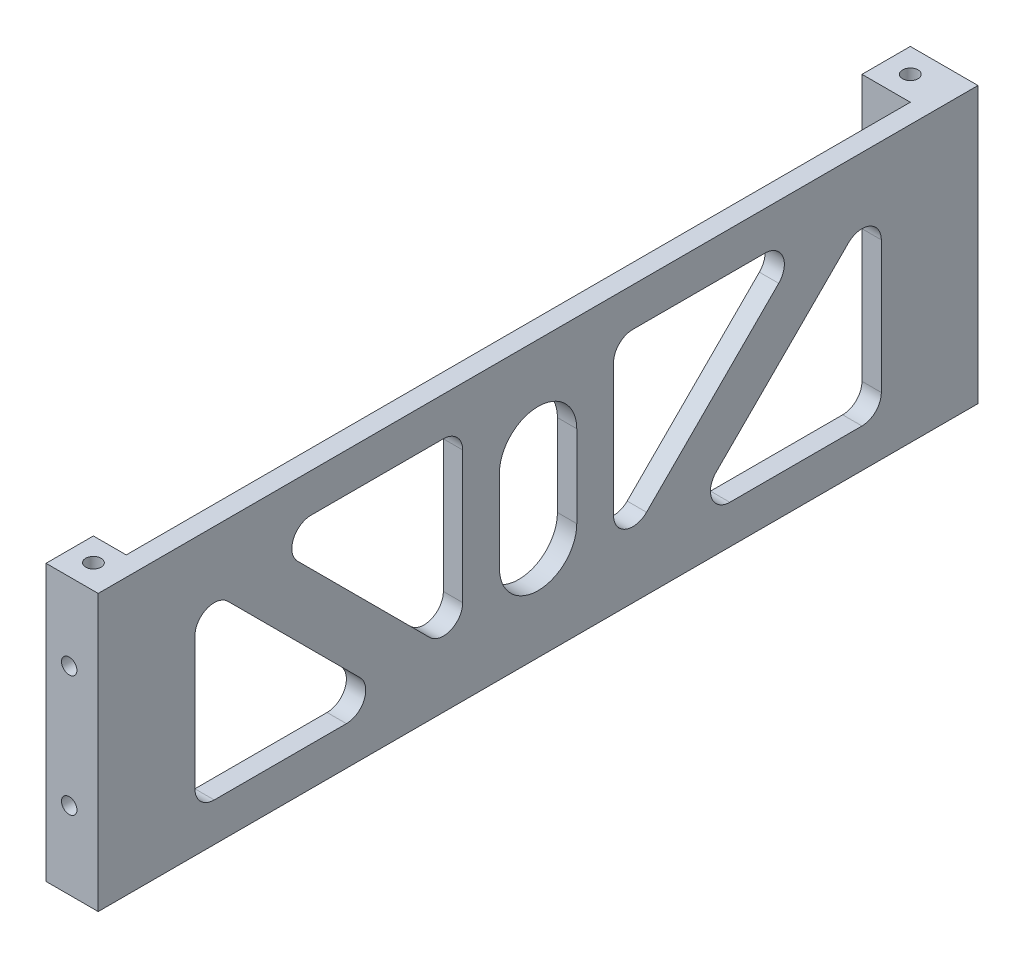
ISO-10303-21;
HEADER;
FILE_DESCRIPTION(('STEP AP214'),'2;1');
FILE_NAME('part.step','',(''),(''),'','','');
FILE_SCHEMA(('AUTOMOTIVE_DESIGN { 1 0 10303 214 1 1 1 1 }'));
ENDSEC;
DATA;
#1=APPLICATION_CONTEXT('core data for automotive mechanical design processes');
#2=APPLICATION_PROTOCOL_DEFINITION('international standard','automotive_design',2000,#1);
#3=PRODUCT_CONTEXT('',#1,'mechanical');
#4=PRODUCT('Part','Part','',(#3));
#5=PRODUCT_RELATED_PRODUCT_CATEGORY('part','',(#4));
#6=PRODUCT_DEFINITION_FORMATION('','',#4);
#7=PRODUCT_DEFINITION_CONTEXT('part definition',#1,'design');
#8=PRODUCT_DEFINITION('design','',#6,#7);
#9=PRODUCT_DEFINITION_SHAPE('','',#8);
#10=(LENGTH_UNIT() NAMED_UNIT(*) SI_UNIT(.MILLI.,.METRE.));
#11=(NAMED_UNIT(*) PLANE_ANGLE_UNIT() SI_UNIT($,.RADIAN.));
#12=(NAMED_UNIT(*) SI_UNIT($,.STERADIAN.) SOLID_ANGLE_UNIT());
#13=UNCERTAINTY_MEASURE_WITH_UNIT(LENGTH_MEASURE(1.E-05),#10,'distance_accuracy_value','');
#14=(GEOMETRIC_REPRESENTATION_CONTEXT(3) GLOBAL_UNCERTAINTY_ASSIGNED_CONTEXT((#13)) GLOBAL_UNIT_ASSIGNED_CONTEXT((#10,
#11,#12)) REPRESENTATION_CONTEXT('',''));
#15=CARTESIAN_POINT('',(0.,0.,0.));
#16=DIRECTION('',(0.,0.,1.));
#17=DIRECTION('',(1.,0.,0.));
#18=AXIS2_PLACEMENT_3D('',#15,#16,#17);
#19=CARTESIAN_POINT('',(0.,0.,0.));
#20=DIRECTION('',(-1.,0.,0.));
#21=DIRECTION('',(0.,0.,1.));
#22=AXIS2_PLACEMENT_3D('',#19,#20,#21);
#23=PLANE('',#22);
#24=CARTESIAN_POINT('',(0.,4.25000000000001,0.));
#25=DIRECTION('',(-1.,0.,0.));
#26=DIRECTION('',(0.,0.,1.));
#27=AXIS2_PLACEMENT_3D('',#24,#25,#26);
#28=CIRCLE('',#27,4.);
#29=CARTESIAN_POINT('',(0.,4.25000000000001,4.));
#30=VERTEX_POINT('',#29);
#31=CARTESIAN_POINT('',(0.,4.25000000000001,-4.));
#32=VERTEX_POINT('',#31);
#33=EDGE_CURVE('E318',#30,#32,#28,.T.);
#34=ORIENTED_EDGE('',*,*,#33,.F.);
#35=DIRECTION('',(0.,1.,0.));
#36=VECTOR('',#35,1.);
#37=CARTESIAN_POINT('',(0.,0.,4.));
#38=LINE('',#37,#36);
#39=CARTESIAN_POINT('',(0.,-4.25,4.));
#40=VERTEX_POINT('',#39);
#41=EDGE_CURVE('E311',#40,#30,#38,.T.);
#42=ORIENTED_EDGE('',*,*,#41,.F.);
#43=CARTESIAN_POINT('',(0.,-4.25,0.));
#44=DIRECTION('',(-1.,0.,0.));
#45=DIRECTION('',(0.,0.,1.));
#46=AXIS2_PLACEMENT_3D('',#43,#44,#45);
#47=CIRCLE('',#46,4.);
#48=CARTESIAN_POINT('',(0.,-4.25,-4.));
#49=VERTEX_POINT('',#48);
#50=EDGE_CURVE('E291',#49,#40,#47,.T.);
#51=ORIENTED_EDGE('',*,*,#50,.F.);
#52=DIRECTION('',(0.,-1.,0.));
#53=VECTOR('',#52,1.);
#54=CARTESIAN_POINT('',(0.,0.,-4.));
#55=LINE('',#54,#53);
#56=EDGE_CURVE('E316',#32,#49,#55,.T.);
#57=ORIENTED_EDGE('',*,*,#56,.F.);
#58=EDGE_LOOP('',(#34,#42,#51,#57));
#59=FACE_BOUND('',#58,.T.);
#60=DIRECTION('',(0.,0.70710678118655,-0.707106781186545));
#61=VECTOR('',#60,1.);
#62=CARTESIAN_POINT('',(0.,-9.02500000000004,-9.02500000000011));
#63=LINE('',#62,#61);
#64=CARTESIAN_POINT('',(0.,-6.83578643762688,-11.2142135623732));
#65=VERTEX_POINT('',#64);
#66=CARTESIAN_POINT('',(0.,6.83578643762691,-24.8857864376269));
#67=VERTEX_POINT('',#66);
#68=EDGE_CURVE('E412',#65,#67,#63,.T.);
#69=ORIENTED_EDGE('',*,*,#68,.T.);
#70=CARTESIAN_POINT('',(0.,8.25,-23.4715728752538));
#71=DIRECTION('',(-1.,0.,0.));
#72=DIRECTION('',(0.,0.,1.));
#73=AXIS2_PLACEMENT_3D('',#70,#71,#72);
#74=CIRCLE('',#73,2.);
#75=CARTESIAN_POINT('',(0.,10.25,-23.4715728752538));
#76=VERTEX_POINT('',#75);
#77=EDGE_CURVE('E415',#67,#76,#74,.F.);
#78=ORIENTED_EDGE('',*,*,#77,.T.);
#79=DIRECTION('',(0.,0.,1.));
#80=VECTOR('',#79,1.);
#81=CARTESIAN_POINT('',(0.,10.25,0.));
#82=LINE('',#81,#80);
#83=CARTESIAN_POINT('',(0.,10.25,-9.80000000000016));
#84=VERTEX_POINT('',#83);
#85=EDGE_CURVE('E390',#76,#84,#82,.T.);
#86=ORIENTED_EDGE('',*,*,#85,.T.);
#87=CARTESIAN_POINT('',(0.,8.25000000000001,-9.80000000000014));
#88=DIRECTION('',(-1.,0.,0.));
#89=DIRECTION('',(0.,0.,1.));
#90=AXIS2_PLACEMENT_3D('',#87,#88,#89);
#91=CIRCLE('',#90,2.);
#92=CARTESIAN_POINT('',(0.,8.24999999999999,-7.80000000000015));
#93=VERTEX_POINT('',#92);
#94=EDGE_CURVE('E403',#84,#93,#91,.F.);
#95=ORIENTED_EDGE('',*,*,#94,.T.);
#96=DIRECTION('',(0.,-1.,0.));
#97=VECTOR('',#96,1.);
#98=CARTESIAN_POINT('',(0.,0.,-7.80000000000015));
#99=LINE('',#98,#97);
#100=CARTESIAN_POINT('',(0.,-5.42157287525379,-7.80000000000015));
#101=VERTEX_POINT('',#100);
#102=EDGE_CURVE('E406',#93,#101,#99,.T.);
#103=ORIENTED_EDGE('',*,*,#102,.T.);
#104=CARTESIAN_POINT('',(0.,-5.42157287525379,-9.80000000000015));
#105=DIRECTION('',(-1.,0.,0.));
#106=DIRECTION('',(0.,0.,1.));
#107=AXIS2_PLACEMENT_3D('',#104,#105,#106);
#108=CIRCLE('',#107,2.);
#109=EDGE_CURVE('E409',#101,#65,#108,.F.);
#110=ORIENTED_EDGE('',*,*,#109,.T.);
#111=EDGE_LOOP('',(#69,#78,#86,#95,#103,#110));
#112=FACE_BOUND('',#111,.T.);
#113=CARTESIAN_POINT('',(0.,-8.25,19.8284271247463));
#114=DIRECTION('',(-1.,0.,0.));
#115=DIRECTION('',(0.,0.,1.));
#116=AXIS2_PLACEMENT_3D('',#113,#114,#115);
#117=CIRCLE('',#116,2.);
#118=CARTESIAN_POINT('',(0.,-6.83578643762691,18.4142135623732));
#119=VERTEX_POINT('',#118);
#120=CARTESIAN_POINT('',(0.,-10.25,19.8284271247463));
#121=VERTEX_POINT('',#120);
#122=EDGE_CURVE('E459',#119,#121,#117,.T.);
#123=ORIENTED_EDGE('',*,*,#122,.F.);
#124=DIRECTION('',(0.,-0.70710678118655,-0.707106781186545));
#125=VECTOR('',#124,1.);
#126=CARTESIAN_POINT('',(0.,-12.625,12.6250000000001));
#127=LINE('',#126,#125);
#128=CARTESIAN_POINT('',(0.,6.83578643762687,32.0857864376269));
#129=VERTEX_POINT('',#128);
#130=EDGE_CURVE('E438',#129,#119,#127,.T.);
#131=ORIENTED_EDGE('',*,*,#130,.F.);
#132=CARTESIAN_POINT('',(0.,5.42157287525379,33.5));
#133=DIRECTION('',(-1.,0.,0.));
#134=DIRECTION('',(0.,0.,1.));
#135=AXIS2_PLACEMENT_3D('',#132,#133,#134);
#136=CIRCLE('',#135,2.);
#137=CARTESIAN_POINT('',(0.,5.42157287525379,35.5));
#138=VERTEX_POINT('',#137);
#139=EDGE_CURVE('E450',#138,#129,#136,.T.);
#140=ORIENTED_EDGE('',*,*,#139,.F.);
#141=DIRECTION('',(0.,1.,0.));
#142=VECTOR('',#141,1.);
#143=CARTESIAN_POINT('',(0.,0.,35.5));
#144=LINE('',#143,#142);
#145=CARTESIAN_POINT('',(0.,-8.24999999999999,35.5));
#146=VERTEX_POINT('',#145);
#147=EDGE_CURVE('E453',#146,#138,#144,.T.);
#148=ORIENTED_EDGE('',*,*,#147,.F.);
#149=CARTESIAN_POINT('',(0.,-8.25,33.5));
#150=DIRECTION('',(-1.,0.,0.));
#151=DIRECTION('',(0.,0.,1.));
#152=AXIS2_PLACEMENT_3D('',#149,#150,#151);
#153=CIRCLE('',#152,2.);
#154=CARTESIAN_POINT('',(0.,-10.25,33.5));
#155=VERTEX_POINT('',#154);
#156=EDGE_CURVE('E455',#155,#146,#153,.T.);
#157=ORIENTED_EDGE('',*,*,#156,.F.);
#158=DIRECTION('',(0.,0.,1.));
#159=VECTOR('',#158,1.);
#160=CARTESIAN_POINT('',(0.,-10.25,0.));
#161=LINE('',#160,#159);
#162=EDGE_CURVE('E457',#121,#155,#161,.T.);
#163=ORIENTED_EDGE('',*,*,#162,.F.);
#164=EDGE_LOOP('',(#123,#131,#140,#148,#157,#163));
#165=FACE_BOUND('',#164,.T.);
#166=CARTESIAN_POINT('',(0.,8.25,23.4715728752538));
#167=DIRECTION('',(-1.,0.,0.));
#168=DIRECTION('',(0.,0.,1.));
#169=AXIS2_PLACEMENT_3D('',#166,#167,#168);
#170=CIRCLE('',#169,2.);
#171=CARTESIAN_POINT('',(0.,6.83578643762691,24.8857864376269));
#172=VERTEX_POINT('',#171);
#173=CARTESIAN_POINT('',(0.,10.25,23.4715728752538));
#174=VERTEX_POINT('',#173);
#175=EDGE_CURVE('E502',#172,#174,#170,.T.);
#176=ORIENTED_EDGE('',*,*,#175,.F.);
#177=DIRECTION('',(0.,0.70710678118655,0.707106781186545));
#178=VECTOR('',#177,1.);
#179=CARTESIAN_POINT('',(0.,-9.02500000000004,9.02500000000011));
#180=LINE('',#179,#178);
#181=CARTESIAN_POINT('',(0.,-6.83578643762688,11.2142135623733));
#182=VERTEX_POINT('',#181);
#183=EDGE_CURVE('E481',#182,#172,#180,.T.);
#184=ORIENTED_EDGE('',*,*,#183,.F.);
#185=CARTESIAN_POINT('',(0.,-5.42157287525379,9.80000000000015));
#186=DIRECTION('',(-1.,0.,0.));
#187=DIRECTION('',(0.,0.,1.));
#188=AXIS2_PLACEMENT_3D('',#185,#186,#187);
#189=CIRCLE('',#188,2.);
#190=CARTESIAN_POINT('',(0.,-5.42157287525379,7.80000000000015));
#191=VERTEX_POINT('',#190);
#192=EDGE_CURVE('E493',#191,#182,#189,.T.);
#193=ORIENTED_EDGE('',*,*,#192,.F.);
#194=DIRECTION('',(0.,-1.,0.));
#195=VECTOR('',#194,1.);
#196=CARTESIAN_POINT('',(0.,0.,7.80000000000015));
#197=LINE('',#196,#195);
#198=CARTESIAN_POINT('',(0.,8.24999999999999,7.80000000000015));
#199=VERTEX_POINT('',#198);
#200=EDGE_CURVE('E496',#199,#191,#197,.T.);
#201=ORIENTED_EDGE('',*,*,#200,.F.);
#202=CARTESIAN_POINT('',(0.,8.25000000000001,9.80000000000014));
#203=DIRECTION('',(-1.,0.,0.));
#204=DIRECTION('',(0.,0.,1.));
#205=AXIS2_PLACEMENT_3D('',#202,#203,#204);
#206=CIRCLE('',#205,2.);
#207=CARTESIAN_POINT('',(0.,10.25,9.80000000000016));
#208=VERTEX_POINT('',#207);
#209=EDGE_CURVE('E498',#208,#199,#206,.T.);
#210=ORIENTED_EDGE('',*,*,#209,.F.);
#211=DIRECTION('',(0.,0.,-1.));
#212=VECTOR('',#211,1.);
#213=CARTESIAN_POINT('',(0.,10.25,0.));
#214=LINE('',#213,#212);
#215=EDGE_CURVE('E500',#174,#208,#214,.T.);
#216=ORIENTED_EDGE('',*,*,#215,.F.);
#217=EDGE_LOOP('',(#176,#184,#193,#201,#210,#216));
#218=FACE_BOUND('',#217,.T.);
#219=DIRECTION('',(0.,0.,-1.));
#220=VECTOR('',#219,1.);
#221=CARTESIAN_POINT('',(0.,-14.25,-45.5));
#222=LINE('',#221,#220);
#223=CARTESIAN_POINT('',(0.,-14.25,40.6));
#224=VERTEX_POINT('',#223);
#225=CARTESIAN_POINT('',(0.,-14.25,-40.5));
#226=VERTEX_POINT('',#225);
#227=EDGE_CURVE('E595',#224,#226,#222,.T.);
#228=ORIENTED_EDGE('',*,*,#227,.F.);
#229=DIRECTION('',(0.,-1.,0.));
#230=VECTOR('',#229,1.);
#231=CARTESIAN_POINT('',(0.,14.25,40.6));
#232=LINE('',#231,#230);
#233=CARTESIAN_POINT('',(0.,14.25,40.6));
#234=VERTEX_POINT('',#233);
#235=EDGE_CURVE('E549',#234,#224,#232,.T.);
#236=ORIENTED_EDGE('',*,*,#235,.F.);
#237=DIRECTION('',(0.,0.,1.));
#238=VECTOR('',#237,1.);
#239=CARTESIAN_POINT('',(0.,14.25,-45.5));
#240=LINE('',#239,#238);
#241=CARTESIAN_POINT('',(0.,14.25,-40.5));
#242=VERTEX_POINT('',#241);
#243=EDGE_CURVE('E586',#242,#234,#240,.T.);
#244=ORIENTED_EDGE('',*,*,#243,.F.);
#245=DIRECTION('',(0.,1.,0.));
#246=VECTOR('',#245,1.);
#247=CARTESIAN_POINT('',(0.,14.25,-40.5));
#248=LINE('',#247,#246);
#249=EDGE_CURVE('E566',#226,#242,#248,.T.);
#250=ORIENTED_EDGE('',*,*,#249,.F.);
#251=EDGE_LOOP('',(#228,#236,#244,#250));
#252=FACE_BOUND('',#251,.T.);
#253=DIRECTION('',(0.,-0.70710678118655,0.707106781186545));
#254=VECTOR('',#253,1.);
#255=CARTESIAN_POINT('',(0.,-12.625,-12.6250000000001));
#256=LINE('',#255,#254);
#257=CARTESIAN_POINT('',(0.,6.83578643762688,-32.0857864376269));
#258=VERTEX_POINT('',#257);
#259=CARTESIAN_POINT('',(0.,-6.83578643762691,-18.4142135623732));
#260=VERTEX_POINT('',#259);
#261=EDGE_CURVE('E363',#258,#260,#256,.T.);
#262=ORIENTED_EDGE('',*,*,#261,.T.);
#263=CARTESIAN_POINT('',(0.,-8.25,-19.8284271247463));
#264=DIRECTION('',(-1.,0.,0.));
#265=DIRECTION('',(0.,0.,1.));
#266=AXIS2_PLACEMENT_3D('',#263,#264,#265);
#267=CIRCLE('',#266,2.);
#268=CARTESIAN_POINT('',(0.,-10.25,-19.8284271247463));
#269=VERTEX_POINT('',#268);
#270=EDGE_CURVE('E366',#260,#269,#267,.F.);
#271=ORIENTED_EDGE('',*,*,#270,.T.);
#272=DIRECTION('',(0.,0.,-1.));
#273=VECTOR('',#272,1.);
#274=CARTESIAN_POINT('',(0.,-10.25,0.));
#275=LINE('',#274,#273);
#276=CARTESIAN_POINT('',(0.,-10.25,-33.5));
#277=VERTEX_POINT('',#276);
#278=EDGE_CURVE('E341',#269,#277,#275,.T.);
#279=ORIENTED_EDGE('',*,*,#278,.T.);
#280=CARTESIAN_POINT('',(0.,-8.25,-33.5));
#281=DIRECTION('',(-1.,0.,0.));
#282=DIRECTION('',(0.,0.,1.));
#283=AXIS2_PLACEMENT_3D('',#280,#281,#282);
#284=CIRCLE('',#283,2.);
#285=CARTESIAN_POINT('',(0.,-8.24999999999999,-35.5));
#286=VERTEX_POINT('',#285);
#287=EDGE_CURVE('E354',#277,#286,#284,.F.);
#288=ORIENTED_EDGE('',*,*,#287,.T.);
#289=DIRECTION('',(0.,1.,0.));
#290=VECTOR('',#289,1.);
#291=CARTESIAN_POINT('',(0.,0.,-35.5));
#292=LINE('',#291,#290);
#293=CARTESIAN_POINT('',(0.,5.42157287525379,-35.5));
#294=VERTEX_POINT('',#293);
#295=EDGE_CURVE('E357',#286,#294,#292,.T.);
#296=ORIENTED_EDGE('',*,*,#295,.T.);
#297=CARTESIAN_POINT('',(0.,5.42157287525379,-33.5));
#298=DIRECTION('',(-1.,0.,0.));
#299=DIRECTION('',(0.,0.,1.));
#300=AXIS2_PLACEMENT_3D('',#297,#298,#299);
#301=CIRCLE('',#300,2.);
#302=EDGE_CURVE('E360',#294,#258,#301,.F.);
#303=ORIENTED_EDGE('',*,*,#302,.T.);
#304=EDGE_LOOP('',(#262,#271,#279,#288,#296,#303));
#305=FACE_BOUND('',#304,.T.);
#306=ADVANCED_FACE('F39',(#59,#112,#165,#218,#252,#305),#23,.T.);
#307=CARTESIAN_POINT('',(2.,0.,0.));
#308=DIRECTION('',(-1.,0.,0.));
#309=DIRECTION('',(0.,0.,1.));
#310=AXIS2_PLACEMENT_3D('',#307,#308,#309);
#311=PLANE('',#310);
#312=DIRECTION('',(0.,-1.,0.));
#313=VECTOR('',#312,1.);
#314=CARTESIAN_POINT('',(2.,4.25000000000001,4.));
#315=LINE('',#314,#313);
#316=CARTESIAN_POINT('',(2.,4.25000000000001,4.));
#317=VERTEX_POINT('',#316);
#318=CARTESIAN_POINT('',(2.,-4.25,4.));
#319=VERTEX_POINT('',#318);
#320=EDGE_CURVE('E297',#317,#319,#315,.T.);
#321=ORIENTED_EDGE('',*,*,#320,.F.);
#322=CARTESIAN_POINT('',(2.,4.25000000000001,0.));
#323=DIRECTION('',(1.,0.,0.));
#324=DIRECTION('',(0.,0.,-1.));
#325=AXIS2_PLACEMENT_3D('',#322,#323,#324);
#326=CIRCLE('',#325,4.);
#327=CARTESIAN_POINT('',(2.,4.25000000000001,-4.));
#328=VERTEX_POINT('',#327);
#329=EDGE_CURVE('E64',#328,#317,#326,.T.);
#330=ORIENTED_EDGE('',*,*,#329,.F.);
#331=DIRECTION('',(0.,1.,0.));
#332=VECTOR('',#331,1.);
#333=CARTESIAN_POINT('',(2.,4.25000000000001,-4.));
#334=LINE('',#333,#332);
#335=CARTESIAN_POINT('',(2.,-4.25,-4.));
#336=VERTEX_POINT('',#335);
#337=EDGE_CURVE('E304',#336,#328,#334,.T.);
#338=ORIENTED_EDGE('',*,*,#337,.F.);
#339=CARTESIAN_POINT('',(2.,-4.25,0.));
#340=DIRECTION('',(1.,0.,0.));
#341=DIRECTION('',(0.,0.,-1.));
#342=AXIS2_PLACEMENT_3D('',#339,#340,#341);
#343=CIRCLE('',#342,4.);
#344=EDGE_CURVE('E288',#319,#336,#343,.T.);
#345=ORIENTED_EDGE('',*,*,#344,.F.);
#346=EDGE_LOOP('',(#321,#330,#338,#345));
#347=FACE_BOUND('',#346,.T.);
#348=CARTESIAN_POINT('',(2.,8.25,-23.4715728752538));
#349=DIRECTION('',(-1.,0.,0.));
#350=DIRECTION('',(0.,0.,-1.));
#351=AXIS2_PLACEMENT_3D('',#348,#349,#350);
#352=CIRCLE('',#351,2.);
#353=CARTESIAN_POINT('',(2.,10.25,-23.4715728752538));
#354=VERTEX_POINT('',#353);
#355=CARTESIAN_POINT('',(2.,6.83578643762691,-24.8857864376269));
#356=VERTEX_POINT('',#355);
#357=EDGE_CURVE('E369',#354,#356,#352,.T.);
#358=ORIENTED_EDGE('',*,*,#357,.T.);
#359=DIRECTION('',(0.,-0.70710678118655,0.707106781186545));
#360=VECTOR('',#359,1.);
#361=CARTESIAN_POINT('',(2.,6.83578643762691,-24.8857864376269));
#362=LINE('',#361,#360);
#363=CARTESIAN_POINT('',(2.,-6.83578643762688,-11.2142135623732));
#364=VERTEX_POINT('',#363);
#365=EDGE_CURVE('E384',#356,#364,#362,.T.);
#366=ORIENTED_EDGE('',*,*,#365,.T.);
#367=CARTESIAN_POINT('',(2.,-5.42157287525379,-9.80000000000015));
#368=DIRECTION('',(-1.,0.,0.));
#369=DIRECTION('',(0.,0.,1.));
#370=AXIS2_PLACEMENT_3D('',#367,#368,#369);
#371=CIRCLE('',#370,2.);
#372=CARTESIAN_POINT('',(2.,-5.42157287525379,-7.80000000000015));
#373=VERTEX_POINT('',#372);
#374=EDGE_CURVE('E381',#364,#373,#371,.T.);
#375=ORIENTED_EDGE('',*,*,#374,.T.);
#376=DIRECTION('',(0.,1.,0.));
#377=VECTOR('',#376,1.);
#378=CARTESIAN_POINT('',(2.,-5.42157287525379,-7.80000000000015));
#379=LINE('',#378,#377);
#380=CARTESIAN_POINT('',(2.,8.24999999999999,-7.80000000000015));
#381=VERTEX_POINT('',#380);
#382=EDGE_CURVE('E378',#373,#381,#379,.T.);
#383=ORIENTED_EDGE('',*,*,#382,.T.);
#384=CARTESIAN_POINT('',(2.,8.25000000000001,-9.80000000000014));
#385=DIRECTION('',(-1.,0.,0.));
#386=DIRECTION('',(0.,0.,1.));
#387=AXIS2_PLACEMENT_3D('',#384,#385,#386);
#388=CIRCLE('',#387,2.);
#389=CARTESIAN_POINT('',(2.,10.25,-9.80000000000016));
#390=VERTEX_POINT('',#389);
#391=EDGE_CURVE('E375',#381,#390,#388,.T.);
#392=ORIENTED_EDGE('',*,*,#391,.T.);
#393=DIRECTION('',(0.,0.,-1.));
#394=VECTOR('',#393,1.);
#395=CARTESIAN_POINT('',(2.,10.25,-9.80000000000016));
#396=LINE('',#395,#394);
#397=EDGE_CURVE('E372',#390,#354,#396,.T.);
#398=ORIENTED_EDGE('',*,*,#397,.T.);
#399=EDGE_LOOP('',(#358,#366,#375,#383,#392,#398));
#400=FACE_BOUND('',#399,.T.);
#401=DIRECTION('',(0.,0.70710678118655,0.707106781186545));
#402=VECTOR('',#401,1.);
#403=CARTESIAN_POINT('',(2.,-6.83578643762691,18.4142135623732));
#404=LINE('',#403,#402);
#405=CARTESIAN_POINT('',(2.,-6.83578643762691,18.4142135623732));
#406=VERTEX_POINT('',#405);
#407=CARTESIAN_POINT('',(2.,6.83578643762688,32.0857864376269));
#408=VERTEX_POINT('',#407);
#409=EDGE_CURVE('E420',#406,#408,#404,.T.);
#410=ORIENTED_EDGE('',*,*,#409,.F.);
#411=CARTESIAN_POINT('',(2.,-8.25,19.8284271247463));
#412=DIRECTION('',(1.,0.,0.));
#413=DIRECTION('',(0.,0.,-1.));
#414=AXIS2_PLACEMENT_3D('',#411,#412,#413);
#415=CIRCLE('',#414,2.);
#416=CARTESIAN_POINT('',(2.,-10.25,19.8284271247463));
#417=VERTEX_POINT('',#416);
#418=EDGE_CURVE('E418',#417,#406,#415,.T.);
#419=ORIENTED_EDGE('',*,*,#418,.F.);
#420=DIRECTION('',(0.,0.,-1.));
#421=VECTOR('',#420,1.);
#422=CARTESIAN_POINT('',(2.,-10.25,33.5));
#423=LINE('',#422,#421);
#424=CARTESIAN_POINT('',(2.,-10.25,33.5));
#425=VERTEX_POINT('',#424);
#426=EDGE_CURVE('E432',#425,#417,#423,.T.);
#427=ORIENTED_EDGE('',*,*,#426,.F.);
#428=CARTESIAN_POINT('',(2.,-8.25,33.5));
#429=DIRECTION('',(1.,0.,0.));
#430=DIRECTION('',(0.,0.,1.));
#431=AXIS2_PLACEMENT_3D('',#428,#429,#430);
#432=CIRCLE('',#431,2.);
#433=CARTESIAN_POINT('',(2.,-8.24999999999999,35.5));
#434=VERTEX_POINT('',#433);
#435=EDGE_CURVE('E429',#434,#425,#432,.T.);
#436=ORIENTED_EDGE('',*,*,#435,.F.);
#437=DIRECTION('',(0.,-1.,0.));
#438=VECTOR('',#437,1.);
#439=CARTESIAN_POINT('',(2.,5.42157287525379,35.5));
#440=LINE('',#439,#438);
#441=CARTESIAN_POINT('',(2.,5.42157287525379,35.5));
#442=VERTEX_POINT('',#441);
#443=EDGE_CURVE('E426',#442,#434,#440,.T.);
#444=ORIENTED_EDGE('',*,*,#443,.F.);
#445=CARTESIAN_POINT('',(2.,5.42157287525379,33.5));
#446=DIRECTION('',(1.,0.,0.));
#447=DIRECTION('',(0.,0.,1.));
#448=AXIS2_PLACEMENT_3D('',#445,#446,#447);
#449=CIRCLE('',#448,2.);
#450=EDGE_CURVE('E423',#408,#442,#449,.T.);
#451=ORIENTED_EDGE('',*,*,#450,.F.);
#452=EDGE_LOOP('',(#410,#419,#427,#436,#444,#451));
#453=FACE_BOUND('',#452,.T.);
#454=DIRECTION('',(0.,-0.70710678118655,-0.707106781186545));
#455=VECTOR('',#454,1.);
#456=CARTESIAN_POINT('',(2.,6.83578643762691,24.8857864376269));
#457=LINE('',#456,#455);
#458=CARTESIAN_POINT('',(2.,6.83578643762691,24.8857864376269));
#459=VERTEX_POINT('',#458);
#460=CARTESIAN_POINT('',(2.,-6.83578643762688,11.2142135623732));
#461=VERTEX_POINT('',#460);
#462=EDGE_CURVE('E463',#459,#461,#457,.T.);
#463=ORIENTED_EDGE('',*,*,#462,.F.);
#464=CARTESIAN_POINT('',(2.,8.25,23.4715728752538));
#465=DIRECTION('',(1.,0.,0.));
#466=DIRECTION('',(0.,0.,1.));
#467=AXIS2_PLACEMENT_3D('',#464,#465,#466);
#468=CIRCLE('',#467,2.);
#469=CARTESIAN_POINT('',(2.,10.25,23.4715728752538));
#470=VERTEX_POINT('',#469);
#471=EDGE_CURVE('E461',#470,#459,#468,.T.);
#472=ORIENTED_EDGE('',*,*,#471,.F.);
#473=DIRECTION('',(0.,0.,1.));
#474=VECTOR('',#473,1.);
#475=CARTESIAN_POINT('',(2.,10.25,9.80000000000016));
#476=LINE('',#475,#474);
#477=CARTESIAN_POINT('',(2.,10.25,9.80000000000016));
#478=VERTEX_POINT('',#477);
#479=EDGE_CURVE('E475',#478,#470,#476,.T.);
#480=ORIENTED_EDGE('',*,*,#479,.F.);
#481=CARTESIAN_POINT('',(2.,8.25000000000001,9.80000000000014));
#482=DIRECTION('',(1.,0.,0.));
#483=DIRECTION('',(0.,0.,-1.));
#484=AXIS2_PLACEMENT_3D('',#481,#482,#483);
#485=CIRCLE('',#484,2.);
#486=CARTESIAN_POINT('',(2.,8.24999999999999,7.80000000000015));
#487=VERTEX_POINT('',#486);
#488=EDGE_CURVE('E472',#487,#478,#485,.T.);
#489=ORIENTED_EDGE('',*,*,#488,.F.);
#490=DIRECTION('',(0.,1.,0.));
#491=VECTOR('',#490,1.);
#492=CARTESIAN_POINT('',(2.,-5.42157287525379,7.80000000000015));
#493=LINE('',#492,#491);
#494=CARTESIAN_POINT('',(2.,-5.42157287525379,7.80000000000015));
#495=VERTEX_POINT('',#494);
#496=EDGE_CURVE('E469',#495,#487,#493,.T.);
#497=ORIENTED_EDGE('',*,*,#496,.F.);
#498=CARTESIAN_POINT('',(2.,-5.42157287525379,9.80000000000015));
#499=DIRECTION('',(1.,0.,0.));
#500=DIRECTION('',(0.,0.,-1.));
#501=AXIS2_PLACEMENT_3D('',#498,#499,#500);
#502=CIRCLE('',#501,2.);
#503=EDGE_CURVE('E466',#461,#495,#502,.T.);
#504=ORIENTED_EDGE('',*,*,#503,.F.);
#505=EDGE_LOOP('',(#463,#472,#480,#489,#497,#504));
#506=FACE_BOUND('',#505,.T.);
#507=DIRECTION('',(0.,-1.,0.));
#508=VECTOR('',#507,1.);
#509=CARTESIAN_POINT('',(2.,14.25,45.5));
#510=LINE('',#509,#508);
#511=CARTESIAN_POINT('',(2.,14.25,45.5));
#512=VERTEX_POINT('',#511);
#513=CARTESIAN_POINT('',(2.,-14.25,45.5));
#514=VERTEX_POINT('',#513);
#515=EDGE_CURVE('E580',#512,#514,#510,.T.);
#516=ORIENTED_EDGE('',*,*,#515,.T.);
#517=DIRECTION('',(0.,0.,-1.));
#518=VECTOR('',#517,1.);
#519=CARTESIAN_POINT('',(2.,-14.25,-45.5));
#520=LINE('',#519,#518);
#521=CARTESIAN_POINT('',(2.,-14.25,-45.5));
#522=VERTEX_POINT('',#521);
#523=EDGE_CURVE('E633',#514,#522,#520,.T.);
#524=ORIENTED_EDGE('',*,*,#523,.T.);
#525=DIRECTION('',(0.,1.,0.));
#526=VECTOR('',#525,1.);
#527=CARTESIAN_POINT('',(2.,14.25,-45.5));
#528=LINE('',#527,#526);
#529=CARTESIAN_POINT('',(2.,14.25,-45.5));
#530=VERTEX_POINT('',#529);
#531=EDGE_CURVE('E615',#522,#530,#528,.T.);
#532=ORIENTED_EDGE('',*,*,#531,.T.);
#533=DIRECTION('',(0.,0.,1.));
#534=VECTOR('',#533,1.);
#535=CARTESIAN_POINT('',(2.,14.25,-45.5));
#536=LINE('',#535,#534);
#537=EDGE_CURVE('E600',#530,#512,#536,.T.);
#538=ORIENTED_EDGE('',*,*,#537,.T.);
#539=EDGE_LOOP('',(#516,#524,#532,#538));
#540=FACE_BOUND('',#539,.T.);
#541=CARTESIAN_POINT('',(2.,-8.25,-19.8284271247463));
#542=DIRECTION('',(-1.,0.,0.));
#543=DIRECTION('',(0.,0.,1.));
#544=AXIS2_PLACEMENT_3D('',#541,#542,#543);
#545=CIRCLE('',#544,2.);
#546=CARTESIAN_POINT('',(2.,-10.25,-19.8284271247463));
#547=VERTEX_POINT('',#546);
#548=CARTESIAN_POINT('',(2.,-6.83578643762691,-18.4142135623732));
#549=VERTEX_POINT('',#548);
#550=EDGE_CURVE('E320',#547,#549,#545,.T.);
#551=ORIENTED_EDGE('',*,*,#550,.T.);
#552=DIRECTION('',(0.,0.70710678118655,-0.707106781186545));
#553=VECTOR('',#552,1.);
#554=CARTESIAN_POINT('',(2.,-6.83578643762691,-18.4142135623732));
#555=LINE('',#554,#553);
#556=CARTESIAN_POINT('',(2.,6.83578643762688,-32.0857864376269));
#557=VERTEX_POINT('',#556);
#558=EDGE_CURVE('E335',#549,#557,#555,.T.);
#559=ORIENTED_EDGE('',*,*,#558,.T.);
#560=CARTESIAN_POINT('',(2.,5.42157287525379,-33.5));
#561=DIRECTION('',(-1.,0.,0.));
#562=DIRECTION('',(0.,0.,-1.));
#563=AXIS2_PLACEMENT_3D('',#560,#561,#562);
#564=CIRCLE('',#563,2.);
#565=CARTESIAN_POINT('',(2.,5.42157287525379,-35.5));
#566=VERTEX_POINT('',#565);
#567=EDGE_CURVE('E332',#557,#566,#564,.T.);
#568=ORIENTED_EDGE('',*,*,#567,.T.);
#569=DIRECTION('',(0.,-1.,0.));
#570=VECTOR('',#569,1.);
#571=CARTESIAN_POINT('',(2.,5.42157287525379,-35.5));
#572=LINE('',#571,#570);
#573=CARTESIAN_POINT('',(2.,-8.24999999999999,-35.5));
#574=VERTEX_POINT('',#573);
#575=EDGE_CURVE('E329',#566,#574,#572,.T.);
#576=ORIENTED_EDGE('',*,*,#575,.T.);
#577=CARTESIAN_POINT('',(2.,-8.25,-33.5));
#578=DIRECTION('',(-1.,0.,0.));
#579=DIRECTION('',(0.,0.,-1.));
#580=AXIS2_PLACEMENT_3D('',#577,#578,#579);
#581=CIRCLE('',#580,2.);
#582=CARTESIAN_POINT('',(2.,-10.25,-33.5));
#583=VERTEX_POINT('',#582);
#584=EDGE_CURVE('E326',#574,#583,#581,.T.);
#585=ORIENTED_EDGE('',*,*,#584,.T.);
#586=DIRECTION('',(0.,0.,1.));
#587=VECTOR('',#586,1.);
#588=CARTESIAN_POINT('',(2.,-10.25,-33.5));
#589=LINE('',#588,#587);
#590=EDGE_CURVE('E323',#583,#547,#589,.T.);
#591=ORIENTED_EDGE('',*,*,#590,.T.);
#592=EDGE_LOOP('',(#551,#559,#568,#576,#585,#591));
#593=FACE_BOUND('',#592,.T.);
#594=ADVANCED_FACE('F301',(#347,#400,#453,#506,#540,#593),#311,.F.);
#595=CARTESIAN_POINT('',(2.,14.25,45.5));
#596=DIRECTION('',(0.,0.,-1.));
#597=DIRECTION('',(-1.,0.,0.));
#598=AXIS2_PLACEMENT_3D('',#595,#596,#597);
#599=PLANE('',#598);
#600=CARTESIAN_POINT('',(-1.,6.25,45.5));
#601=DIRECTION('',(0.,0.,1.));
#602=DIRECTION('',(1.,0.,0.));
#603=AXIS2_PLACEMENT_3D('',#600,#601,#602);
#604=CIRCLE('',#603,0.79999999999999);
#605=CARTESIAN_POINT('',(-0.20000000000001,6.25,45.5));
#606=VERTEX_POINT('',#605);
#607=EDGE_CURVE('E504',#606,#606,#604,.T.);
#608=ORIENTED_EDGE('',*,*,#607,.F.);
#609=EDGE_LOOP('',(#608));
#610=FACE_BOUND('',#609,.T.);
#611=CARTESIAN_POINT('',(-1.,-6.25,45.5));
#612=DIRECTION('',(0.,0.,1.));
#613=DIRECTION('',(1.,0.,0.));
#614=AXIS2_PLACEMENT_3D('',#611,#612,#613);
#615=CIRCLE('',#614,0.79999999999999);
#616=CARTESIAN_POINT('',(-0.20000000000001,-6.25,45.5));
#617=VERTEX_POINT('',#616);
#618=EDGE_CURVE('E510',#617,#617,#615,.T.);
#619=ORIENTED_EDGE('',*,*,#618,.F.);
#620=EDGE_LOOP('',(#619));
#621=FACE_BOUND('',#620,.T.);
#622=DIRECTION('',(-1.,0.,0.));
#623=VECTOR('',#622,1.);
#624=CARTESIAN_POINT('',(2.,14.25,45.5));
#625=LINE('',#624,#623);
#626=CARTESIAN_POINT('',(-3.4,14.25,45.5));
#627=VERTEX_POINT('',#626);
#628=EDGE_CURVE('E604',#512,#627,#625,.T.);
#629=ORIENTED_EDGE('',*,*,#628,.T.);
#630=DIRECTION('',(0.,1.,0.));
#631=VECTOR('',#630,1.);
#632=CARTESIAN_POINT('',(-3.4,14.25,45.5));
#633=LINE('',#632,#631);
#634=CARTESIAN_POINT('',(-3.4,-14.25,45.5));
#635=VERTEX_POINT('',#634);
#636=EDGE_CURVE('E550',#635,#627,#633,.T.);
#637=ORIENTED_EDGE('',*,*,#636,.F.);
#638=DIRECTION('',(-1.,0.,0.));
#639=VECTOR('',#638,1.);
#640=CARTESIAN_POINT('',(2.,-14.25,45.5));
#641=LINE('',#640,#639);
#642=EDGE_CURVE('E11',#514,#635,#641,.T.);
#643=ORIENTED_EDGE('',*,*,#642,.F.);
#644=ORIENTED_EDGE('',*,*,#515,.F.);
#645=EDGE_LOOP('',(#629,#637,#643,#644));
#646=FACE_BOUND('',#645,.T.);
#647=ADVANCED_FACE('F41',(#610,#621,#646),#599,.F.);
#648=CARTESIAN_POINT('',(2.,-14.25,-45.5));
#649=DIRECTION('',(0.,1.,0.));
#650=DIRECTION('',(0.,0.,1.));
#651=AXIS2_PLACEMENT_3D('',#648,#649,#650);
#652=PLANE('',#651);
#653=CARTESIAN_POINT('',(-1.,-14.25,43.));
#654=DIRECTION('',(0.,-1.,0.));
#655=DIRECTION('',(0.,0.,-1.));
#656=AXIS2_PLACEMENT_3D('',#653,#654,#655);
#657=CIRCLE('',#656,0.79999999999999);
#658=CARTESIAN_POINT('',(-1.,-14.25,42.2));
#659=VERTEX_POINT('',#658);
#660=EDGE_CURVE('E537',#659,#659,#657,.T.);
#661=ORIENTED_EDGE('',*,*,#660,.F.);
#662=EDGE_LOOP('',(#661));
#663=FACE_BOUND('',#662,.T.);
#664=CARTESIAN_POINT('',(-2.5,-14.25,-43.));
#665=DIRECTION('',(0.,-1.,0.));
#666=DIRECTION('',(0.,0.,-1.));
#667=AXIS2_PLACEMENT_3D('',#664,#665,#666);
#668=CIRCLE('',#667,0.79999999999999);
#669=CARTESIAN_POINT('',(-2.5,-14.25,-43.8));
#670=VERTEX_POINT('',#669);
#671=EDGE_CURVE('E543',#670,#670,#668,.T.);
#672=ORIENTED_EDGE('',*,*,#671,.F.);
#673=EDGE_LOOP('',(#672));
#674=FACE_BOUND('',#673,.T.);
#675=ORIENTED_EDGE('',*,*,#642,.T.);
#676=DIRECTION('',(0.,0.,1.));
#677=VECTOR('',#676,1.);
#678=CARTESIAN_POINT('',(-3.4,-14.25,45.5));
#679=LINE('',#678,#677);
#680=CARTESIAN_POINT('',(-3.4,-14.25,40.6));
#681=VERTEX_POINT('',#680);
#682=EDGE_CURVE('E557',#681,#635,#679,.T.);
#683=ORIENTED_EDGE('',*,*,#682,.F.);
#684=DIRECTION('',(1.,0.,0.));
#685=VECTOR('',#684,1.);
#686=CARTESIAN_POINT('',(-3.4,-14.25,40.6));
#687=LINE('',#686,#685);
#688=EDGE_CURVE('E560',#681,#224,#687,.T.);
#689=ORIENTED_EDGE('',*,*,#688,.T.);
#690=ORIENTED_EDGE('',*,*,#227,.T.);
#691=DIRECTION('',(1.,0.,0.));
#692=VECTOR('',#691,1.);
#693=CARTESIAN_POINT('',(-5.,-14.25,-40.5));
#694=LINE('',#693,#692);
#695=CARTESIAN_POINT('',(-5.,-14.25,-40.5));
#696=VERTEX_POINT('',#695);
#697=EDGE_CURVE('E590',#696,#226,#694,.T.);
#698=ORIENTED_EDGE('',*,*,#697,.F.);
#699=DIRECTION('',(0.,0.,1.));
#700=VECTOR('',#699,1.);
#701=CARTESIAN_POINT('',(-5.,-14.25,-45.5));
#702=LINE('',#701,#700);
#703=CARTESIAN_POINT('',(-5.,-14.25,-45.5));
#704=VERTEX_POINT('',#703);
#705=EDGE_CURVE('E570',#704,#696,#702,.T.);
#706=ORIENTED_EDGE('',*,*,#705,.F.);
#707=DIRECTION('',(-1.,0.,0.));
#708=VECTOR('',#707,1.);
#709=CARTESIAN_POINT('',(2.,-14.25,-45.5));
#710=LINE('',#709,#708);
#711=EDGE_CURVE('E48',#522,#704,#710,.T.);
#712=ORIENTED_EDGE('',*,*,#711,.F.);
#713=ORIENTED_EDGE('',*,*,#523,.F.);
#714=EDGE_LOOP('',(#675,#683,#689,#690,#698,#706,#712,#713));
#715=FACE_BOUND('',#714,.T.);
#716=ADVANCED_FACE('F618',(#663,#674,#715),#652,.F.);
#717=CARTESIAN_POINT('',(2.,14.25,-45.5));
#718=DIRECTION('',(0.,0.,1.));
#719=DIRECTION('',(1.,0.,0.));
#720=AXIS2_PLACEMENT_3D('',#717,#718,#719);
#721=PLANE('',#720);
#722=CARTESIAN_POINT('',(-1.5,6.25000000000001,-45.5));
#723=DIRECTION('',(0.,0.,-1.));
#724=DIRECTION('',(-1.,0.,0.));
#725=AXIS2_PLACEMENT_3D('',#722,#723,#724);
#726=CIRCLE('',#725,0.79999999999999);
#727=CARTESIAN_POINT('',(-2.29999999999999,6.25000000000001,-45.5));
#728=VERTEX_POINT('',#727);
#729=EDGE_CURVE('E516',#728,#728,#726,.T.);
#730=ORIENTED_EDGE('',*,*,#729,.F.);
#731=EDGE_LOOP('',(#730));
#732=FACE_BOUND('',#731,.T.);
#733=CARTESIAN_POINT('',(-1.5,-6.25,-45.5));
#734=DIRECTION('',(0.,0.,-1.));
#735=DIRECTION('',(-1.,0.,0.));
#736=AXIS2_PLACEMENT_3D('',#733,#734,#735);
#737=CIRCLE('',#736,0.79999999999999);
#738=CARTESIAN_POINT('',(-2.29999999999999,-6.25,-45.5));
#739=VERTEX_POINT('',#738);
#740=EDGE_CURVE('E519',#739,#739,#737,.T.);
#741=ORIENTED_EDGE('',*,*,#740,.F.);
#742=EDGE_LOOP('',(#741));
#743=FACE_BOUND('',#742,.T.);
#744=ORIENTED_EDGE('',*,*,#711,.T.);
#745=DIRECTION('',(0.,-1.,0.));
#746=VECTOR('',#745,1.);
#747=CARTESIAN_POINT('',(-5.,14.25,-45.5));
#748=LINE('',#747,#746);
#749=CARTESIAN_POINT('',(-5.,14.25,-45.5));
#750=VERTEX_POINT('',#749);
#751=EDGE_CURVE('E567',#750,#704,#748,.T.);
#752=ORIENTED_EDGE('',*,*,#751,.F.);
#753=DIRECTION('',(-1.,0.,0.));
#754=VECTOR('',#753,1.);
#755=CARTESIAN_POINT('',(2.,14.25,-45.5));
#756=LINE('',#755,#754);
#757=EDGE_CURVE('E606',#530,#750,#756,.T.);
#758=ORIENTED_EDGE('',*,*,#757,.F.);
#759=ORIENTED_EDGE('',*,*,#531,.F.);
#760=EDGE_LOOP('',(#744,#752,#758,#759));
#761=FACE_BOUND('',#760,.T.);
#762=ADVANCED_FACE('F613',(#732,#743,#761),#721,.F.);
#763=CARTESIAN_POINT('',(2.,14.25,-45.5));
#764=DIRECTION('',(0.,-1.,0.));
#765=DIRECTION('',(0.,0.,-1.));
#766=AXIS2_PLACEMENT_3D('',#763,#764,#765);
#767=PLANE('',#766);
#768=CARTESIAN_POINT('',(-1.,14.25,43.));
#769=DIRECTION('',(0.,1.,0.));
#770=DIRECTION('',(0.,0.,1.));
#771=AXIS2_PLACEMENT_3D('',#768,#769,#770);
#772=CIRCLE('',#771,0.79999999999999);
#773=CARTESIAN_POINT('',(-1.,14.25,43.8));
#774=VERTEX_POINT('',#773);
#775=EDGE_CURVE('E525',#774,#774,#772,.T.);
#776=ORIENTED_EDGE('',*,*,#775,.F.);
#777=EDGE_LOOP('',(#776));
#778=FACE_BOUND('',#777,.T.);
#779=CARTESIAN_POINT('',(-2.5,14.25,-43.));
#780=DIRECTION('',(0.,1.,0.));
#781=DIRECTION('',(0.,0.,1.));
#782=AXIS2_PLACEMENT_3D('',#779,#780,#781);
#783=CIRCLE('',#782,0.79999999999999);
#784=CARTESIAN_POINT('',(-2.5,14.25,-42.2));
#785=VERTEX_POINT('',#784);
#786=EDGE_CURVE('E531',#785,#785,#783,.T.);
#787=ORIENTED_EDGE('',*,*,#786,.F.);
#788=EDGE_LOOP('',(#787));
#789=FACE_BOUND('',#788,.T.);
#790=ORIENTED_EDGE('',*,*,#757,.T.);
#791=DIRECTION('',(0.,0.,-1.));
#792=VECTOR('',#791,1.);
#793=CARTESIAN_POINT('',(-5.,14.25,-45.5));
#794=LINE('',#793,#792);
#795=CARTESIAN_POINT('',(-5.,14.25,-40.5));
#796=VERTEX_POINT('',#795);
#797=EDGE_CURVE('E574',#796,#750,#794,.T.);
#798=ORIENTED_EDGE('',*,*,#797,.F.);
#799=DIRECTION('',(1.,0.,0.));
#800=VECTOR('',#799,1.);
#801=CARTESIAN_POINT('',(-5.,14.25,-40.5));
#802=LINE('',#801,#800);
#803=EDGE_CURVE('E577',#796,#242,#802,.T.);
#804=ORIENTED_EDGE('',*,*,#803,.T.);
#805=ORIENTED_EDGE('',*,*,#243,.T.);
#806=DIRECTION('',(1.,0.,0.));
#807=VECTOR('',#806,1.);
#808=CARTESIAN_POINT('',(-3.4,14.25,40.6));
#809=LINE('',#808,#807);
#810=CARTESIAN_POINT('',(-3.4,14.25,40.6));
#811=VERTEX_POINT('',#810);
#812=EDGE_CURVE('E564',#811,#234,#809,.T.);
#813=ORIENTED_EDGE('',*,*,#812,.F.);
#814=DIRECTION('',(0.,0.,-1.));
#815=VECTOR('',#814,1.);
#816=CARTESIAN_POINT('',(-3.4,14.25,45.5));
#817=LINE('',#816,#815);
#818=EDGE_CURVE('E553',#627,#811,#817,.T.);
#819=ORIENTED_EDGE('',*,*,#818,.F.);
#820=ORIENTED_EDGE('',*,*,#628,.F.);
#821=ORIENTED_EDGE('',*,*,#537,.F.);
#822=EDGE_LOOP('',(#790,#798,#804,#805,#813,#819,#820,#821));
#823=FACE_BOUND('',#822,.T.);
#824=ADVANCED_FACE('F625',(#778,#789,#823),#767,.F.);
#825=CARTESIAN_POINT('',(-5.,14.25,-40.5));
#826=DIRECTION('',(0.,0.,-1.));
#827=DIRECTION('',(0.,1.,0.));
#828=AXIS2_PLACEMENT_3D('',#825,#826,#827);
#829=PLANE('',#828);
#830=CARTESIAN_POINT('',(-1.5,6.25000000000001,-40.5));
#831=DIRECTION('',(0.,0.,-1.));
#832=DIRECTION('',(0.,1.,0.));
#833=AXIS2_PLACEMENT_3D('',#830,#831,#832);
#834=CIRCLE('',#833,0.799999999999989);
#835=CARTESIAN_POINT('',(-1.5,7.04999999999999,-40.5));
#836=VERTEX_POINT('',#835);
#837=EDGE_CURVE('E43',#836,#836,#834,.T.);
#838=ORIENTED_EDGE('',*,*,#837,.T.);
#839=EDGE_LOOP('',(#838));
#840=FACE_BOUND('',#839,.T.);
#841=CARTESIAN_POINT('',(-1.5,-6.25,-40.5));
#842=DIRECTION('',(0.,0.,-1.));
#843=DIRECTION('',(0.,1.,0.));
#844=AXIS2_PLACEMENT_3D('',#841,#842,#843);
#845=CIRCLE('',#844,0.799999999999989);
#846=CARTESIAN_POINT('',(-1.5,-5.45000000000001,-40.5));
#847=VERTEX_POINT('',#846);
#848=EDGE_CURVE('E522',#847,#847,#845,.T.);
#849=ORIENTED_EDGE('',*,*,#848,.T.);
#850=EDGE_LOOP('',(#849));
#851=FACE_BOUND('',#850,.T.);
#852=ORIENTED_EDGE('',*,*,#249,.T.);
#853=ORIENTED_EDGE('',*,*,#803,.F.);
#854=DIRECTION('',(0.,1.,0.));
#855=VECTOR('',#854,1.);
#856=CARTESIAN_POINT('',(-5.,14.25,-40.5));
#857=LINE('',#856,#855);
#858=EDGE_CURVE('E572',#696,#796,#857,.T.);
#859=ORIENTED_EDGE('',*,*,#858,.F.);
#860=ORIENTED_EDGE('',*,*,#697,.T.);
#861=EDGE_LOOP('',(#852,#853,#859,#860));
#862=FACE_BOUND('',#861,.T.);
#863=ADVANCED_FACE('F643',(#840,#851,#862),#829,.F.);
#864=CARTESIAN_POINT('',(-5.,0.,0.));
#865=DIRECTION('',(-1.,0.,0.));
#866=DIRECTION('',(0.,0.,1.));
#867=AXIS2_PLACEMENT_3D('',#864,#865,#866);
#868=PLANE('',#867);
#869=ORIENTED_EDGE('',*,*,#751,.T.);
#870=ORIENTED_EDGE('',*,*,#705,.T.);
#871=ORIENTED_EDGE('',*,*,#858,.T.);
#872=ORIENTED_EDGE('',*,*,#797,.T.);
#873=EDGE_LOOP('',(#869,#870,#871,#872));
#874=FACE_BOUND('',#873,.T.);
#875=ADVANCED_FACE('F621',(#874),#868,.T.);
#876=CARTESIAN_POINT('',(-3.4,14.25,40.6));
#877=DIRECTION('',(0.,0.,1.));
#878=DIRECTION('',(0.,-1.,0.));
#879=AXIS2_PLACEMENT_3D('',#876,#877,#878);
#880=PLANE('',#879);
#881=CARTESIAN_POINT('',(-1.,6.25,40.6));
#882=DIRECTION('',(0.,0.,1.));
#883=DIRECTION('',(0.,-1.,0.));
#884=AXIS2_PLACEMENT_3D('',#881,#882,#883);
#885=CIRCLE('',#884,0.799999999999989);
#886=CARTESIAN_POINT('',(-1.,5.45000000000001,40.6));
#887=VERTEX_POINT('',#886);
#888=EDGE_CURVE('E507',#887,#887,#885,.T.);
#889=ORIENTED_EDGE('',*,*,#888,.T.);
#890=EDGE_LOOP('',(#889));
#891=FACE_BOUND('',#890,.T.);
#892=CARTESIAN_POINT('',(-1.,-6.25,40.6));
#893=DIRECTION('',(0.,0.,1.));
#894=DIRECTION('',(0.,-1.,0.));
#895=AXIS2_PLACEMENT_3D('',#892,#893,#894);
#896=CIRCLE('',#895,0.799999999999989);
#897=CARTESIAN_POINT('',(-1.,-7.04999999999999,40.6));
#898=VERTEX_POINT('',#897);
#899=EDGE_CURVE('E513',#898,#898,#896,.T.);
#900=ORIENTED_EDGE('',*,*,#899,.T.);
#901=EDGE_LOOP('',(#900));
#902=FACE_BOUND('',#901,.T.);
#903=ORIENTED_EDGE('',*,*,#235,.T.);
#904=ORIENTED_EDGE('',*,*,#688,.F.);
#905=DIRECTION('',(0.,-1.,0.));
#906=VECTOR('',#905,1.);
#907=CARTESIAN_POINT('',(-3.4,14.25,40.6));
#908=LINE('',#907,#906);
#909=EDGE_CURVE('E555',#811,#681,#908,.T.);
#910=ORIENTED_EDGE('',*,*,#909,.F.);
#911=ORIENTED_EDGE('',*,*,#812,.T.);
#912=EDGE_LOOP('',(#903,#904,#910,#911));
#913=FACE_BOUND('',#912,.T.);
#914=ADVANCED_FACE('F651',(#891,#902,#913),#880,.F.);
#915=CARTESIAN_POINT('',(-3.4,0.,0.));
#916=DIRECTION('',(1.,0.,0.));
#917=DIRECTION('',(0.,0.,-1.));
#918=AXIS2_PLACEMENT_3D('',#915,#916,#917);
#919=PLANE('',#918);
#920=ORIENTED_EDGE('',*,*,#636,.T.);
#921=ORIENTED_EDGE('',*,*,#818,.T.);
#922=ORIENTED_EDGE('',*,*,#909,.T.);
#923=ORIENTED_EDGE('',*,*,#682,.T.);
#924=EDGE_LOOP('',(#920,#921,#922,#923));
#925=FACE_BOUND('',#924,.T.);
#926=ADVANCED_FACE('F693',(#925),#919,.F.);
#927=CARTESIAN_POINT('',(-2.5,-9.05,-43.));
#928=DIRECTION('',(0.,-1.,0.));
#929=DIRECTION('',(0.,0.,-1.));
#930=AXIS2_PLACEMENT_3D('',#927,#928,#929);
#931=CONICAL_SURFACE('',#930,0.799999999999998,1.02974425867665);
#932=CARTESIAN_POINT('',(-2.5,-8.56931150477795,-43.));
#933=VERTEX_POINT('',#932);
#934=VERTEX_LOOP('',#933);
#935=FACE_BOUND('',#934,.T.);
#936=CARTESIAN_POINT('',(-2.5,-9.05,-43.));
#937=DIRECTION('',(0.,-1.,0.));
#938=DIRECTION('',(0.,0.,-1.));
#939=AXIS2_PLACEMENT_3D('',#936,#937,#938);
#940=CIRCLE('',#939,0.799999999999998);
#941=CARTESIAN_POINT('',(-2.5,-9.05,-43.8));
#942=VERTEX_POINT('',#941);
#943=EDGE_CURVE('E546',#942,#942,#940,.T.);
#944=ORIENTED_EDGE('',*,*,#943,.T.);
#945=EDGE_LOOP('',(#944));
#946=FACE_BOUND('',#945,.T.);
#947=ADVANCED_FACE('F683',(#935,#946),#931,.F.);
#948=CARTESIAN_POINT('',(-2.5,-14.25,-43.));
#949=DIRECTION('',(0.,-1.,0.));
#950=DIRECTION('',(0.,0.,-1.));
#951=AXIS2_PLACEMENT_3D('',#948,#949,#950);
#952=CYLINDRICAL_SURFACE('',#951,0.799999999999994);
#953=ORIENTED_EDGE('',*,*,#943,.F.);
#954=EDGE_LOOP('',(#953));
#955=FACE_BOUND('',#954,.T.);
#956=ORIENTED_EDGE('',*,*,#671,.T.);
#957=EDGE_LOOP('',(#956));
#958=FACE_BOUND('',#957,.T.);
#959=ADVANCED_FACE('F680',(#955,#958),#952,.F.);
#960=CARTESIAN_POINT('',(-1.,-9.05,43.));
#961=DIRECTION('',(0.,-1.,0.));
#962=DIRECTION('',(0.,0.,-1.));
#963=AXIS2_PLACEMENT_3D('',#960,#961,#962);
#964=CONICAL_SURFACE('',#963,0.799999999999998,1.02974425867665);
#965=CARTESIAN_POINT('',(-1.,-8.56931150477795,43.));
#966=VERTEX_POINT('',#965);
#967=VERTEX_LOOP('',#966);
#968=FACE_BOUND('',#967,.T.);
#969=CARTESIAN_POINT('',(-1.,-9.05,43.));
#970=DIRECTION('',(0.,-1.,0.));
#971=DIRECTION('',(0.,0.,-1.));
#972=AXIS2_PLACEMENT_3D('',#969,#970,#971);
#973=CIRCLE('',#972,0.799999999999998);
#974=CARTESIAN_POINT('',(-1.,-9.05,42.2));
#975=VERTEX_POINT('',#974);
#976=EDGE_CURVE('E540',#975,#975,#973,.T.);
#977=ORIENTED_EDGE('',*,*,#976,.T.);
#978=EDGE_LOOP('',(#977));
#979=FACE_BOUND('',#978,.T.);
#980=ADVANCED_FACE('F682',(#968,#979),#964,.F.);
#981=CARTESIAN_POINT('',(-1.,-14.25,43.));
#982=DIRECTION('',(0.,-1.,0.));
#983=DIRECTION('',(0.,0.,-1.));
#984=AXIS2_PLACEMENT_3D('',#981,#982,#983);
#985=CYLINDRICAL_SURFACE('',#984,0.799999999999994);
#986=ORIENTED_EDGE('',*,*,#976,.F.);
#987=EDGE_LOOP('',(#986));
#988=FACE_BOUND('',#987,.T.);
#989=ORIENTED_EDGE('',*,*,#660,.T.);
#990=EDGE_LOOP('',(#989));
#991=FACE_BOUND('',#990,.T.);
#992=ADVANCED_FACE('F690',(#988,#991),#985,.F.);
#993=CARTESIAN_POINT('',(-2.5,9.05,-43.));
#994=DIRECTION('',(0.,1.,0.));
#995=DIRECTION('',(0.,0.,1.));
#996=AXIS2_PLACEMENT_3D('',#993,#994,#995);
#997=CONICAL_SURFACE('',#996,0.799999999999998,1.02974425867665);
#998=CARTESIAN_POINT('',(-2.5,8.56931150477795,-43.));
#999=VERTEX_POINT('',#998);
#1000=VERTEX_LOOP('',#999);
#1001=FACE_BOUND('',#1000,.T.);
#1002=CARTESIAN_POINT('',(-2.5,9.05,-43.));
#1003=DIRECTION('',(0.,1.,0.));
#1004=DIRECTION('',(0.,0.,1.));
#1005=AXIS2_PLACEMENT_3D('',#1002,#1003,#1004);
#1006=CIRCLE('',#1005,0.799999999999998);
#1007=CARTESIAN_POINT('',(-2.5,9.05,-42.2));
#1008=VERTEX_POINT('',#1007);
#1009=EDGE_CURVE('E534',#1008,#1008,#1006,.T.);
#1010=ORIENTED_EDGE('',*,*,#1009,.T.);
#1011=EDGE_LOOP('',(#1010));
#1012=FACE_BOUND('',#1011,.T.);
#1013=ADVANCED_FACE('F748',(#1001,#1012),#997,.F.);
#1014=CARTESIAN_POINT('',(-2.5,14.25,-43.));
#1015=DIRECTION('',(0.,1.,0.));
#1016=DIRECTION('',(0.,0.,1.));
#1017=AXIS2_PLACEMENT_3D('',#1014,#1015,#1016);
#1018=CYLINDRICAL_SURFACE('',#1017,0.799999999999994);
#1019=ORIENTED_EDGE('',*,*,#1009,.F.);
#1020=EDGE_LOOP('',(#1019));
#1021=FACE_BOUND('',#1020,.T.);
#1022=ORIENTED_EDGE('',*,*,#786,.T.);
#1023=EDGE_LOOP('',(#1022));
#1024=FACE_BOUND('',#1023,.T.);
#1025=ADVANCED_FACE('F744',(#1021,#1024),#1018,.F.);
#1026=CARTESIAN_POINT('',(-1.,9.05,43.));
#1027=DIRECTION('',(0.,1.,0.));
#1028=DIRECTION('',(0.,0.,1.));
#1029=AXIS2_PLACEMENT_3D('',#1026,#1027,#1028);
#1030=CONICAL_SURFACE('',#1029,0.799999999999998,1.02974425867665);
#1031=CARTESIAN_POINT('',(-1.,8.56931150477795,43.));
#1032=VERTEX_POINT('',#1031);
#1033=VERTEX_LOOP('',#1032);
#1034=FACE_BOUND('',#1033,.T.);
#1035=CARTESIAN_POINT('',(-1.,9.05,43.));
#1036=DIRECTION('',(0.,1.,0.));
#1037=DIRECTION('',(0.,0.,1.));
#1038=AXIS2_PLACEMENT_3D('',#1035,#1036,#1037);
#1039=CIRCLE('',#1038,0.799999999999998);
#1040=CARTESIAN_POINT('',(-1.,9.05,43.8));
#1041=VERTEX_POINT('',#1040);
#1042=EDGE_CURVE('E528',#1041,#1041,#1039,.T.);
#1043=ORIENTED_EDGE('',*,*,#1042,.T.);
#1044=EDGE_LOOP('',(#1043));
#1045=FACE_BOUND('',#1044,.T.);
#1046=ADVANCED_FACE('F740',(#1034,#1045),#1030,.F.);
#1047=CARTESIAN_POINT('',(-1.,14.25,43.));
#1048=DIRECTION('',(0.,1.,0.));
#1049=DIRECTION('',(0.,0.,1.));
#1050=AXIS2_PLACEMENT_3D('',#1047,#1048,#1049);
#1051=CYLINDRICAL_SURFACE('',#1050,0.799999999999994);
#1052=ORIENTED_EDGE('',*,*,#1042,.F.);
#1053=EDGE_LOOP('',(#1052));
#1054=FACE_BOUND('',#1053,.T.);
#1055=ORIENTED_EDGE('',*,*,#775,.T.);
#1056=EDGE_LOOP('',(#1055));
#1057=FACE_BOUND('',#1056,.T.);
#1058=ADVANCED_FACE('F736',(#1054,#1057),#1051,.F.);
#1059=CARTESIAN_POINT('',(-1.5,-6.25,-45.5));
#1060=DIRECTION('',(0.,0.,-1.));
#1061=DIRECTION('',(-1.,0.,0.));
#1062=AXIS2_PLACEMENT_3D('',#1059,#1060,#1061);
#1063=CYLINDRICAL_SURFACE('',#1062,0.799999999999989);
#1064=ORIENTED_EDGE('',*,*,#740,.T.);
#1065=EDGE_LOOP('',(#1064));
#1066=FACE_BOUND('',#1065,.T.);
#1067=ORIENTED_EDGE('',*,*,#848,.F.);
#1068=EDGE_LOOP('',(#1067));
#1069=FACE_BOUND('',#1068,.T.);
#1070=ADVANCED_FACE('F729',(#1066,#1069),#1063,.F.);
#1071=CARTESIAN_POINT('',(-1.5,6.25000000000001,-45.5));
#1072=DIRECTION('',(0.,0.,-1.));
#1073=DIRECTION('',(-1.,0.,0.));
#1074=AXIS2_PLACEMENT_3D('',#1071,#1072,#1073);
#1075=CYLINDRICAL_SURFACE('',#1074,0.799999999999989);
#1076=ORIENTED_EDGE('',*,*,#729,.T.);
#1077=EDGE_LOOP('',(#1076));
#1078=FACE_BOUND('',#1077,.T.);
#1079=ORIENTED_EDGE('',*,*,#837,.F.);
#1080=EDGE_LOOP('',(#1079));
#1081=FACE_BOUND('',#1080,.T.);
#1082=ADVANCED_FACE('F718',(#1078,#1081),#1075,.F.);
#1083=CARTESIAN_POINT('',(-1.,-6.25,45.5));
#1084=DIRECTION('',(0.,0.,1.));
#1085=DIRECTION('',(1.,0.,0.));
#1086=AXIS2_PLACEMENT_3D('',#1083,#1084,#1085);
#1087=CYLINDRICAL_SURFACE('',#1086,0.799999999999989);
#1088=ORIENTED_EDGE('',*,*,#618,.T.);
#1089=EDGE_LOOP('',(#1088));
#1090=FACE_BOUND('',#1089,.T.);
#1091=ORIENTED_EDGE('',*,*,#899,.F.);
#1092=EDGE_LOOP('',(#1091));
#1093=FACE_BOUND('',#1092,.T.);
#1094=ADVANCED_FACE('F715',(#1090,#1093),#1087,.F.);
#1095=CARTESIAN_POINT('',(-1.,6.25,45.5));
#1096=DIRECTION('',(0.,0.,1.));
#1097=DIRECTION('',(1.,0.,0.));
#1098=AXIS2_PLACEMENT_3D('',#1095,#1096,#1097);
#1099=CYLINDRICAL_SURFACE('',#1098,0.799999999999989);
#1100=ORIENTED_EDGE('',*,*,#607,.T.);
#1101=EDGE_LOOP('',(#1100));
#1102=FACE_BOUND('',#1101,.T.);
#1103=ORIENTED_EDGE('',*,*,#888,.F.);
#1104=EDGE_LOOP('',(#1103));
#1105=FACE_BOUND('',#1104,.T.);
#1106=ADVANCED_FACE('F717',(#1102,#1105),#1099,.F.);
#1107=CARTESIAN_POINT('',(-5.000025,8.25,23.4715728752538));
#1108=DIRECTION('',(1.,0.,0.));
#1109=DIRECTION('',(0.,0.,-1.));
#1110=AXIS2_PLACEMENT_3D('',#1107,#1108,#1109);
#1111=CYLINDRICAL_SURFACE('',#1110,2.);
#1112=ORIENTED_EDGE('',*,*,#175,.T.);
#1113=DIRECTION('',(1.,0.,0.));
#1114=VECTOR('',#1113,1.);
#1115=CARTESIAN_POINT('',(-5.000025,10.25,23.4715728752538));
#1116=LINE('',#1115,#1114);
#1117=EDGE_CURVE('E479',#174,#470,#1116,.T.);
#1118=ORIENTED_EDGE('',*,*,#1117,.T.);
#1119=ORIENTED_EDGE('',*,*,#471,.T.);
#1120=DIRECTION('',(1.,0.,0.));
#1121=VECTOR('',#1120,1.);
#1122=CARTESIAN_POINT('',(-5.000025,6.83578643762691,24.8857864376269));
#1123=LINE('',#1122,#1121);
#1124=EDGE_CURVE('E478',#172,#459,#1123,.T.);
#1125=ORIENTED_EDGE('',*,*,#1124,.F.);
#1126=EDGE_LOOP('',(#1112,#1118,#1119,#1125));
#1127=FACE_BOUND('',#1126,.T.);
#1128=ADVANCED_FACE('F725',(#1127),#1111,.F.);
#1129=CARTESIAN_POINT('',(-5.000025,10.25,9.80000000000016));
#1130=DIRECTION('',(0.,1.,0.));
#1131=DIRECTION('',(0.,0.,1.));
#1132=AXIS2_PLACEMENT_3D('',#1129,#1130,#1131);
#1133=PLANE('',#1132);
#1134=ORIENTED_EDGE('',*,*,#215,.T.);
#1135=DIRECTION('',(1.,0.,0.));
#1136=VECTOR('',#1135,1.);
#1137=CARTESIAN_POINT('',(-5.000025,10.25,9.80000000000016));
#1138=LINE('',#1137,#1136);
#1139=EDGE_CURVE('E482',#208,#478,#1138,.T.);
#1140=ORIENTED_EDGE('',*,*,#1139,.T.);
#1141=ORIENTED_EDGE('',*,*,#479,.T.);
#1142=ORIENTED_EDGE('',*,*,#1117,.F.);
#1143=EDGE_LOOP('',(#1134,#1140,#1141,#1142));
#1144=FACE_BOUND('',#1143,.T.);
#1145=ADVANCED_FACE('F816',(#1144),#1133,.F.);
#1146=CARTESIAN_POINT('',(-5.000025,8.25000000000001,9.80000000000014));
#1147=DIRECTION('',(1.,0.,0.));
#1148=DIRECTION('',(0.,0.,-1.));
#1149=AXIS2_PLACEMENT_3D('',#1146,#1147,#1148);
#1150=CYLINDRICAL_SURFACE('',#1149,2.);
#1151=ORIENTED_EDGE('',*,*,#209,.T.);
#1152=DIRECTION('',(1.,0.,0.));
#1153=VECTOR('',#1152,1.);
#1154=CARTESIAN_POINT('',(-5.000025,8.24999999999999,7.80000000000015));
#1155=LINE('',#1154,#1153);
#1156=EDGE_CURVE('E484',#199,#487,#1155,.T.);
#1157=ORIENTED_EDGE('',*,*,#1156,.T.);
#1158=ORIENTED_EDGE('',*,*,#488,.T.);
#1159=ORIENTED_EDGE('',*,*,#1139,.F.);
#1160=EDGE_LOOP('',(#1151,#1157,#1158,#1159));
#1161=FACE_BOUND('',#1160,.T.);
#1162=ADVANCED_FACE('F823',(#1161),#1150,.F.);
#1163=CARTESIAN_POINT('',(-5.000025,-5.42157287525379,7.80000000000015));
#1164=DIRECTION('',(0.,0.,-1.));
#1165=DIRECTION('',(0.,1.,0.));
#1166=AXIS2_PLACEMENT_3D('',#1163,#1164,#1165);
#1167=PLANE('',#1166);
#1168=ORIENTED_EDGE('',*,*,#200,.T.);
#1169=DIRECTION('',(1.,0.,0.));
#1170=VECTOR('',#1169,1.);
#1171=CARTESIAN_POINT('',(-5.000025,-5.42157287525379,7.80000000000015));
#1172=LINE('',#1171,#1170);
#1173=EDGE_CURVE('E486',#191,#495,#1172,.T.);
#1174=ORIENTED_EDGE('',*,*,#1173,.T.);
#1175=ORIENTED_EDGE('',*,*,#496,.T.);
#1176=ORIENTED_EDGE('',*,*,#1156,.F.);
#1177=EDGE_LOOP('',(#1168,#1174,#1175,#1176));
#1178=FACE_BOUND('',#1177,.T.);
#1179=ADVANCED_FACE('F831',(#1178),#1167,.F.);
#1180=CARTESIAN_POINT('',(-5.000025,-5.42157287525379,9.80000000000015));
#1181=DIRECTION('',(1.,0.,0.));
#1182=DIRECTION('',(0.,0.,-1.));
#1183=AXIS2_PLACEMENT_3D('',#1180,#1181,#1182);
#1184=CYLINDRICAL_SURFACE('',#1183,2.);
#1185=ORIENTED_EDGE('',*,*,#192,.T.);
#1186=DIRECTION('',(1.,0.,0.));
#1187=VECTOR('',#1186,1.);
#1188=CARTESIAN_POINT('',(-5.000025,-6.83578643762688,11.2142135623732));
#1189=LINE('',#1188,#1187);
#1190=EDGE_CURVE('E488',#182,#461,#1189,.T.);
#1191=ORIENTED_EDGE('',*,*,#1190,.T.);
#1192=ORIENTED_EDGE('',*,*,#503,.T.);
#1193=ORIENTED_EDGE('',*,*,#1173,.F.);
#1194=EDGE_LOOP('',(#1185,#1191,#1192,#1193));
#1195=FACE_BOUND('',#1194,.T.);
#1196=ADVANCED_FACE('F839',(#1195),#1184,.F.);
#1197=CARTESIAN_POINT('',(-5.000025,6.83578643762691,24.8857864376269));
#1198=DIRECTION('',(0.,-0.707106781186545,0.70710678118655));
#1199=DIRECTION('',(0.,-0.70710678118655,-0.707106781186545));
#1200=AXIS2_PLACEMENT_3D('',#1197,#1198,#1199);
#1201=PLANE('',#1200);
#1202=ORIENTED_EDGE('',*,*,#183,.T.);
#1203=ORIENTED_EDGE('',*,*,#1124,.T.);
#1204=ORIENTED_EDGE('',*,*,#462,.T.);
#1205=ORIENTED_EDGE('',*,*,#1190,.F.);
#1206=EDGE_LOOP('',(#1202,#1203,#1204,#1205));
#1207=FACE_BOUND('',#1206,.T.);
#1208=ADVANCED_FACE('F847',(#1207),#1201,.F.);
#1209=CARTESIAN_POINT('',(-5.000025,-8.25,19.8284271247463));
#1210=DIRECTION('',(1.,0.,0.));
#1211=DIRECTION('',(0.,0.,-1.));
#1212=AXIS2_PLACEMENT_3D('',#1209,#1210,#1211);
#1213=CYLINDRICAL_SURFACE('',#1212,2.);
#1214=ORIENTED_EDGE('',*,*,#122,.T.);
#1215=DIRECTION('',(1.,0.,0.));
#1216=VECTOR('',#1215,1.);
#1217=CARTESIAN_POINT('',(-5.000025,-10.25,19.8284271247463));
#1218=LINE('',#1217,#1216);
#1219=EDGE_CURVE('E436',#121,#417,#1218,.T.);
#1220=ORIENTED_EDGE('',*,*,#1219,.T.);
#1221=ORIENTED_EDGE('',*,*,#418,.T.);
#1222=DIRECTION('',(1.,0.,0.));
#1223=VECTOR('',#1222,1.);
#1224=CARTESIAN_POINT('',(-5.000025,-6.83578643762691,18.4142135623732));
#1225=LINE('',#1224,#1223);
#1226=EDGE_CURVE('E435',#119,#406,#1225,.T.);
#1227=ORIENTED_EDGE('',*,*,#1226,.F.);
#1228=EDGE_LOOP('',(#1214,#1220,#1221,#1227));
#1229=FACE_BOUND('',#1228,.T.);
#1230=ADVANCED_FACE('F855',(#1229),#1213,.F.);
#1231=CARTESIAN_POINT('',(-5.000025,-10.25,33.5));
#1232=DIRECTION('',(0.,-1.,0.));
#1233=DIRECTION('',(0.,0.,-1.));
#1234=AXIS2_PLACEMENT_3D('',#1231,#1232,#1233);
#1235=PLANE('',#1234);
#1236=ORIENTED_EDGE('',*,*,#162,.T.);
#1237=DIRECTION('',(1.,0.,0.));
#1238=VECTOR('',#1237,1.);
#1239=CARTESIAN_POINT('',(-5.000025,-10.25,33.5));
#1240=LINE('',#1239,#1238);
#1241=EDGE_CURVE('E439',#155,#425,#1240,.T.);
#1242=ORIENTED_EDGE('',*,*,#1241,.T.);
#1243=ORIENTED_EDGE('',*,*,#426,.T.);
#1244=ORIENTED_EDGE('',*,*,#1219,.F.);
#1245=EDGE_LOOP('',(#1236,#1242,#1243,#1244));
#1246=FACE_BOUND('',#1245,.T.);
#1247=ADVANCED_FACE('F863',(#1246),#1235,.F.);
#1248=CARTESIAN_POINT('',(-5.000025,-8.25,33.5));
#1249=DIRECTION('',(1.,0.,0.));
#1250=DIRECTION('',(0.,0.,-1.));
#1251=AXIS2_PLACEMENT_3D('',#1248,#1249,#1250);
#1252=CYLINDRICAL_SURFACE('',#1251,2.);
#1253=ORIENTED_EDGE('',*,*,#156,.T.);
#1254=DIRECTION('',(1.,0.,0.));
#1255=VECTOR('',#1254,1.);
#1256=CARTESIAN_POINT('',(-5.000025,-8.24999999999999,35.5));
#1257=LINE('',#1256,#1255);
#1258=EDGE_CURVE('E441',#146,#434,#1257,.T.);
#1259=ORIENTED_EDGE('',*,*,#1258,.T.);
#1260=ORIENTED_EDGE('',*,*,#435,.T.);
#1261=ORIENTED_EDGE('',*,*,#1241,.F.);
#1262=EDGE_LOOP('',(#1253,#1259,#1260,#1261));
#1263=FACE_BOUND('',#1262,.T.);
#1264=ADVANCED_FACE('F871',(#1263),#1252,.F.);
#1265=CARTESIAN_POINT('',(-5.000025,5.42157287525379,35.5));
#1266=DIRECTION('',(0.,0.,1.));
#1267=DIRECTION('',(0.,-1.,0.));
#1268=AXIS2_PLACEMENT_3D('',#1265,#1266,#1267);
#1269=PLANE('',#1268);
#1270=ORIENTED_EDGE('',*,*,#147,.T.);
#1271=DIRECTION('',(1.,0.,0.));
#1272=VECTOR('',#1271,1.);
#1273=CARTESIAN_POINT('',(-5.000025,5.42157287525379,35.5));
#1274=LINE('',#1273,#1272);
#1275=EDGE_CURVE('E443',#138,#442,#1274,.T.);
#1276=ORIENTED_EDGE('',*,*,#1275,.T.);
#1277=ORIENTED_EDGE('',*,*,#443,.T.);
#1278=ORIENTED_EDGE('',*,*,#1258,.F.);
#1279=EDGE_LOOP('',(#1270,#1276,#1277,#1278));
#1280=FACE_BOUND('',#1279,.T.);
#1281=ADVANCED_FACE('F879',(#1280),#1269,.F.);
#1282=CARTESIAN_POINT('',(-5.000025,5.42157287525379,33.5));
#1283=DIRECTION('',(1.,0.,0.));
#1284=DIRECTION('',(0.,0.,-1.));
#1285=AXIS2_PLACEMENT_3D('',#1282,#1283,#1284);
#1286=CYLINDRICAL_SURFACE('',#1285,2.);
#1287=ORIENTED_EDGE('',*,*,#139,.T.);
#1288=DIRECTION('',(1.,0.,0.));
#1289=VECTOR('',#1288,1.);
#1290=CARTESIAN_POINT('',(-5.000025,6.83578643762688,32.0857864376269));
#1291=LINE('',#1290,#1289);
#1292=EDGE_CURVE('E445',#129,#408,#1291,.T.);
#1293=ORIENTED_EDGE('',*,*,#1292,.T.);
#1294=ORIENTED_EDGE('',*,*,#450,.T.);
#1295=ORIENTED_EDGE('',*,*,#1275,.F.);
#1296=EDGE_LOOP('',(#1287,#1293,#1294,#1295));
#1297=FACE_BOUND('',#1296,.T.);
#1298=ADVANCED_FACE('F887',(#1297),#1286,.F.);
#1299=CARTESIAN_POINT('',(-5.000025,-6.83578643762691,18.4142135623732));
#1300=DIRECTION('',(0.,0.707106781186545,-0.70710678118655));
#1301=DIRECTION('',(0.,0.70710678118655,0.707106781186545));
#1302=AXIS2_PLACEMENT_3D('',#1299,#1300,#1301);
#1303=PLANE('',#1302);
#1304=ORIENTED_EDGE('',*,*,#130,.T.);
#1305=ORIENTED_EDGE('',*,*,#1226,.T.);
#1306=ORIENTED_EDGE('',*,*,#409,.T.);
#1307=ORIENTED_EDGE('',*,*,#1292,.F.);
#1308=EDGE_LOOP('',(#1304,#1305,#1306,#1307));
#1309=FACE_BOUND('',#1308,.T.);
#1310=ADVANCED_FACE('F895',(#1309),#1303,.F.);
#1311=CARTESIAN_POINT('',(-5.000025,8.25,-23.4715728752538));
#1312=DIRECTION('',(1.,0.,0.));
#1313=DIRECTION('',(0.,0.,-1.));
#1314=AXIS2_PLACEMENT_3D('',#1311,#1312,#1313);
#1315=CYLINDRICAL_SURFACE('',#1314,2.);
#1316=DIRECTION('',(1.,0.,0.));
#1317=VECTOR('',#1316,1.);
#1318=CARTESIAN_POINT('',(-5.000025,6.83578643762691,-24.8857864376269));
#1319=LINE('',#1318,#1317);
#1320=EDGE_CURVE('E388',#67,#356,#1319,.T.);
#1321=ORIENTED_EDGE('',*,*,#1320,.T.);
#1322=ORIENTED_EDGE('',*,*,#357,.F.);
#1323=DIRECTION('',(1.,0.,0.));
#1324=VECTOR('',#1323,1.);
#1325=CARTESIAN_POINT('',(-5.000025,10.25,-23.4715728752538));
#1326=LINE('',#1325,#1324);
#1327=EDGE_CURVE('E387',#76,#354,#1326,.T.);
#1328=ORIENTED_EDGE('',*,*,#1327,.F.);
#1329=ORIENTED_EDGE('',*,*,#77,.F.);
#1330=EDGE_LOOP('',(#1321,#1322,#1328,#1329));
#1331=FACE_BOUND('',#1330,.T.);
#1332=ADVANCED_FACE('F903',(#1331),#1315,.F.);
#1333=CARTESIAN_POINT('',(-5.000025,6.83578643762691,-24.8857864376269));
#1334=DIRECTION('',(0.,0.707106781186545,0.70710678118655));
#1335=DIRECTION('',(0.,-0.70710678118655,0.707106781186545));
#1336=AXIS2_PLACEMENT_3D('',#1333,#1334,#1335);
#1337=PLANE('',#1336);
#1338=DIRECTION('',(1.,0.,0.));
#1339=VECTOR('',#1338,1.);
#1340=CARTESIAN_POINT('',(-5.000025,-6.83578643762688,-11.2142135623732));
#1341=LINE('',#1340,#1339);
#1342=EDGE_CURVE('E391',#65,#364,#1341,.T.);
#1343=ORIENTED_EDGE('',*,*,#1342,.T.);
#1344=ORIENTED_EDGE('',*,*,#365,.F.);
#1345=ORIENTED_EDGE('',*,*,#1320,.F.);
#1346=ORIENTED_EDGE('',*,*,#68,.F.);
#1347=EDGE_LOOP('',(#1343,#1344,#1345,#1346));
#1348=FACE_BOUND('',#1347,.T.);
#1349=ADVANCED_FACE('F910',(#1348),#1337,.T.);
#1350=CARTESIAN_POINT('',(-5.000025,-5.42157287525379,-9.80000000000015));
#1351=DIRECTION('',(1.,0.,0.));
#1352=DIRECTION('',(0.,0.,-1.));
#1353=AXIS2_PLACEMENT_3D('',#1350,#1351,#1352);
#1354=CYLINDRICAL_SURFACE('',#1353,2.);
#1355=DIRECTION('',(1.,0.,0.));
#1356=VECTOR('',#1355,1.);
#1357=CARTESIAN_POINT('',(-5.000025,-5.42157287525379,-7.80000000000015));
#1358=LINE('',#1357,#1356);
#1359=EDGE_CURVE('E393',#101,#373,#1358,.T.);
#1360=ORIENTED_EDGE('',*,*,#1359,.T.);
#1361=ORIENTED_EDGE('',*,*,#374,.F.);
#1362=ORIENTED_EDGE('',*,*,#1342,.F.);
#1363=ORIENTED_EDGE('',*,*,#109,.F.);
#1364=EDGE_LOOP('',(#1360,#1361,#1362,#1363));
#1365=FACE_BOUND('',#1364,.T.);
#1366=ADVANCED_FACE('F917',(#1365),#1354,.F.);
#1367=CARTESIAN_POINT('',(-5.000025,-5.42157287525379,-7.80000000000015));
#1368=DIRECTION('',(0.,0.,-1.));
#1369=DIRECTION('',(0.,1.,0.));
#1370=AXIS2_PLACEMENT_3D('',#1367,#1368,#1369);
#1371=PLANE('',#1370);
#1372=DIRECTION('',(1.,0.,0.));
#1373=VECTOR('',#1372,1.);
#1374=CARTESIAN_POINT('',(-5.000025,8.24999999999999,-7.80000000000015));
#1375=LINE('',#1374,#1373);
#1376=EDGE_CURVE('E395',#93,#381,#1375,.T.);
#1377=ORIENTED_EDGE('',*,*,#1376,.T.);
#1378=ORIENTED_EDGE('',*,*,#382,.F.);
#1379=ORIENTED_EDGE('',*,*,#1359,.F.);
#1380=ORIENTED_EDGE('',*,*,#102,.F.);
#1381=EDGE_LOOP('',(#1377,#1378,#1379,#1380));
#1382=FACE_BOUND('',#1381,.T.);
#1383=ADVANCED_FACE('F925',(#1382),#1371,.T.);
#1384=CARTESIAN_POINT('',(-5.000025,8.25000000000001,-9.80000000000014));
#1385=DIRECTION('',(1.,0.,0.));
#1386=DIRECTION('',(0.,0.,-1.));
#1387=AXIS2_PLACEMENT_3D('',#1384,#1385,#1386);
#1388=CYLINDRICAL_SURFACE('',#1387,2.);
#1389=DIRECTION('',(1.,0.,0.));
#1390=VECTOR('',#1389,1.);
#1391=CARTESIAN_POINT('',(-5.000025,10.25,-9.80000000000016));
#1392=LINE('',#1391,#1390);
#1393=EDGE_CURVE('E397',#84,#390,#1392,.T.);
#1394=ORIENTED_EDGE('',*,*,#1393,.T.);
#1395=ORIENTED_EDGE('',*,*,#391,.F.);
#1396=ORIENTED_EDGE('',*,*,#1376,.F.);
#1397=ORIENTED_EDGE('',*,*,#94,.F.);
#1398=EDGE_LOOP('',(#1394,#1395,#1396,#1397));
#1399=FACE_BOUND('',#1398,.T.);
#1400=ADVANCED_FACE('F933',(#1399),#1388,.F.);
#1401=CARTESIAN_POINT('',(-5.000025,10.25,-9.80000000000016));
#1402=DIRECTION('',(0.,-1.,0.));
#1403=DIRECTION('',(0.,0.,-1.));
#1404=AXIS2_PLACEMENT_3D('',#1401,#1402,#1403);
#1405=PLANE('',#1404);
#1406=ORIENTED_EDGE('',*,*,#1327,.T.);
#1407=ORIENTED_EDGE('',*,*,#397,.F.);
#1408=ORIENTED_EDGE('',*,*,#1393,.F.);
#1409=ORIENTED_EDGE('',*,*,#85,.F.);
#1410=EDGE_LOOP('',(#1406,#1407,#1408,#1409));
#1411=FACE_BOUND('',#1410,.T.);
#1412=ADVANCED_FACE('F941',(#1411),#1405,.T.);
#1413=CARTESIAN_POINT('',(-5.000025,-8.25,-19.8284271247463));
#1414=DIRECTION('',(1.,0.,0.));
#1415=DIRECTION('',(0.,0.,-1.));
#1416=AXIS2_PLACEMENT_3D('',#1413,#1414,#1415);
#1417=CYLINDRICAL_SURFACE('',#1416,2.);
#1418=DIRECTION('',(1.,0.,0.));
#1419=VECTOR('',#1418,1.);
#1420=CARTESIAN_POINT('',(-5.000025,-6.83578643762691,-18.4142135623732));
#1421=LINE('',#1420,#1419);
#1422=EDGE_CURVE('E339',#260,#549,#1421,.T.);
#1423=ORIENTED_EDGE('',*,*,#1422,.T.);
#1424=ORIENTED_EDGE('',*,*,#550,.F.);
#1425=DIRECTION('',(1.,0.,0.));
#1426=VECTOR('',#1425,1.);
#1427=CARTESIAN_POINT('',(-5.000025,-10.25,-19.8284271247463));
#1428=LINE('',#1427,#1426);
#1429=EDGE_CURVE('E338',#269,#547,#1428,.T.);
#1430=ORIENTED_EDGE('',*,*,#1429,.F.);
#1431=ORIENTED_EDGE('',*,*,#270,.F.);
#1432=EDGE_LOOP('',(#1423,#1424,#1430,#1431));
#1433=FACE_BOUND('',#1432,.T.);
#1434=ADVANCED_FACE('F949',(#1433),#1417,.F.);
#1435=CARTESIAN_POINT('',(-5.000025,-6.83578643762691,-18.4142135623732));
#1436=DIRECTION('',(0.,-0.707106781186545,-0.70710678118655));
#1437=DIRECTION('',(0.,0.70710678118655,-0.707106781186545));
#1438=AXIS2_PLACEMENT_3D('',#1435,#1436,#1437);
#1439=PLANE('',#1438);
#1440=DIRECTION('',(1.,0.,0.));
#1441=VECTOR('',#1440,1.);
#1442=CARTESIAN_POINT('',(-5.000025,6.83578643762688,-32.0857864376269));
#1443=LINE('',#1442,#1441);
#1444=EDGE_CURVE('E342',#258,#557,#1443,.T.);
#1445=ORIENTED_EDGE('',*,*,#1444,.T.);
#1446=ORIENTED_EDGE('',*,*,#558,.F.);
#1447=ORIENTED_EDGE('',*,*,#1422,.F.);
#1448=ORIENTED_EDGE('',*,*,#261,.F.);
#1449=EDGE_LOOP('',(#1445,#1446,#1447,#1448));
#1450=FACE_BOUND('',#1449,.T.);
#1451=ADVANCED_FACE('F957',(#1450),#1439,.T.);
#1452=CARTESIAN_POINT('',(-5.000025,5.42157287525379,-33.5));
#1453=DIRECTION('',(1.,0.,0.));
#1454=DIRECTION('',(0.,0.,-1.));
#1455=AXIS2_PLACEMENT_3D('',#1452,#1453,#1454);
#1456=CYLINDRICAL_SURFACE('',#1455,2.);
#1457=DIRECTION('',(1.,0.,0.));
#1458=VECTOR('',#1457,1.);
#1459=CARTESIAN_POINT('',(-5.000025,5.42157287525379,-35.5));
#1460=LINE('',#1459,#1458);
#1461=EDGE_CURVE('E344',#294,#566,#1460,.T.);
#1462=ORIENTED_EDGE('',*,*,#1461,.T.);
#1463=ORIENTED_EDGE('',*,*,#567,.F.);
#1464=ORIENTED_EDGE('',*,*,#1444,.F.);
#1465=ORIENTED_EDGE('',*,*,#302,.F.);
#1466=EDGE_LOOP('',(#1462,#1463,#1464,#1465));
#1467=FACE_BOUND('',#1466,.T.);
#1468=ADVANCED_FACE('F965',(#1467),#1456,.F.);
#1469=CARTESIAN_POINT('',(-5.000025,5.42157287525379,-35.5));
#1470=DIRECTION('',(0.,0.,1.));
#1471=DIRECTION('',(0.,-1.,0.));
#1472=AXIS2_PLACEMENT_3D('',#1469,#1470,#1471);
#1473=PLANE('',#1472);
#1474=DIRECTION('',(1.,0.,0.));
#1475=VECTOR('',#1474,1.);
#1476=CARTESIAN_POINT('',(-5.000025,-8.24999999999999,-35.5));
#1477=LINE('',#1476,#1475);
#1478=EDGE_CURVE('E346',#286,#574,#1477,.T.);
#1479=ORIENTED_EDGE('',*,*,#1478,.T.);
#1480=ORIENTED_EDGE('',*,*,#575,.F.);
#1481=ORIENTED_EDGE('',*,*,#1461,.F.);
#1482=ORIENTED_EDGE('',*,*,#295,.F.);
#1483=EDGE_LOOP('',(#1479,#1480,#1481,#1482));
#1484=FACE_BOUND('',#1483,.T.);
#1485=ADVANCED_FACE('F973',(#1484),#1473,.T.);
#1486=CARTESIAN_POINT('',(-5.000025,-8.25,-33.5));
#1487=DIRECTION('',(1.,0.,0.));
#1488=DIRECTION('',(0.,0.,-1.));
#1489=AXIS2_PLACEMENT_3D('',#1486,#1487,#1488);
#1490=CYLINDRICAL_SURFACE('',#1489,2.);
#1491=DIRECTION('',(1.,0.,0.));
#1492=VECTOR('',#1491,1.);
#1493=CARTESIAN_POINT('',(-5.000025,-10.25,-33.5));
#1494=LINE('',#1493,#1492);
#1495=EDGE_CURVE('E348',#277,#583,#1494,.T.);
#1496=ORIENTED_EDGE('',*,*,#1495,.T.);
#1497=ORIENTED_EDGE('',*,*,#584,.F.);
#1498=ORIENTED_EDGE('',*,*,#1478,.F.);
#1499=ORIENTED_EDGE('',*,*,#287,.F.);
#1500=EDGE_LOOP('',(#1496,#1497,#1498,#1499));
#1501=FACE_BOUND('',#1500,.T.);
#1502=ADVANCED_FACE('F981',(#1501),#1490,.F.);
#1503=CARTESIAN_POINT('',(-5.000025,-10.25,-33.5));
#1504=DIRECTION('',(0.,1.,0.));
#1505=DIRECTION('',(0.,0.,1.));
#1506=AXIS2_PLACEMENT_3D('',#1503,#1504,#1505);
#1507=PLANE('',#1506);
#1508=ORIENTED_EDGE('',*,*,#1429,.T.);
#1509=ORIENTED_EDGE('',*,*,#590,.F.);
#1510=ORIENTED_EDGE('',*,*,#1495,.F.);
#1511=ORIENTED_EDGE('',*,*,#278,.F.);
#1512=EDGE_LOOP('',(#1508,#1509,#1510,#1511));
#1513=FACE_BOUND('',#1512,.T.);
#1514=ADVANCED_FACE('F989',(#1513),#1507,.T.);
#1515=CARTESIAN_POINT('',(-8.,4.25000000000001,0.));
#1516=DIRECTION('',(1.,0.,0.));
#1517=DIRECTION('',(0.,0.,-1.));
#1518=AXIS2_PLACEMENT_3D('',#1515,#1516,#1517);
#1519=CYLINDRICAL_SURFACE('',#1518,4.);
#1520=ORIENTED_EDGE('',*,*,#33,.T.);
#1521=DIRECTION('',(1.,0.,0.));
#1522=VECTOR('',#1521,1.);
#1523=CARTESIAN_POINT('',(-8.,4.25000000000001,-4.));
#1524=LINE('',#1523,#1522);
#1525=EDGE_CURVE('E309',#32,#328,#1524,.T.);
#1526=ORIENTED_EDGE('',*,*,#1525,.T.);
#1527=ORIENTED_EDGE('',*,*,#329,.T.);
#1528=DIRECTION('',(1.,0.,0.));
#1529=VECTOR('',#1528,1.);
#1530=CARTESIAN_POINT('',(-8.,4.25000000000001,4.));
#1531=LINE('',#1530,#1529);
#1532=EDGE_CURVE('E294',#30,#317,#1531,.T.);
#1533=ORIENTED_EDGE('',*,*,#1532,.F.);
#1534=EDGE_LOOP('',(#1520,#1526,#1527,#1533));
#1535=FACE_BOUND('',#1534,.T.);
#1536=ADVANCED_FACE('F996',(#1535),#1519,.F.);
#1537=CARTESIAN_POINT('',(-8.,4.25000000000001,-4.));
#1538=DIRECTION('',(0.,0.,-1.));
#1539=DIRECTION('',(0.,1.,0.));
#1540=AXIS2_PLACEMENT_3D('',#1537,#1538,#1539);
#1541=PLANE('',#1540);
#1542=ORIENTED_EDGE('',*,*,#56,.T.);
#1543=DIRECTION('',(1.,0.,0.));
#1544=VECTOR('',#1543,1.);
#1545=CARTESIAN_POINT('',(-8.,-4.25,-4.));
#1546=LINE('',#1545,#1544);
#1547=EDGE_CURVE('E293',#49,#336,#1546,.T.);
#1548=ORIENTED_EDGE('',*,*,#1547,.T.);
#1549=ORIENTED_EDGE('',*,*,#337,.T.);
#1550=ORIENTED_EDGE('',*,*,#1525,.F.);
#1551=EDGE_LOOP('',(#1542,#1548,#1549,#1550));
#1552=FACE_BOUND('',#1551,.T.);
#1553=ADVANCED_FACE('F1003',(#1552),#1541,.F.);
#1554=CARTESIAN_POINT('',(-8.,-4.25,0.));
#1555=DIRECTION('',(1.,0.,0.));
#1556=DIRECTION('',(0.,0.,-1.));
#1557=AXIS2_PLACEMENT_3D('',#1554,#1555,#1556);
#1558=CYLINDRICAL_SURFACE('',#1557,4.);
#1559=ORIENTED_EDGE('',*,*,#50,.T.);
#1560=DIRECTION('',(1.,0.,0.));
#1561=VECTOR('',#1560,1.);
#1562=CARTESIAN_POINT('',(-8.,-4.25,4.));
#1563=LINE('',#1562,#1561);
#1564=EDGE_CURVE('E56',#40,#319,#1563,.T.);
#1565=ORIENTED_EDGE('',*,*,#1564,.T.);
#1566=ORIENTED_EDGE('',*,*,#344,.T.);
#1567=ORIENTED_EDGE('',*,*,#1547,.F.);
#1568=EDGE_LOOP('',(#1559,#1565,#1566,#1567));
#1569=FACE_BOUND('',#1568,.T.);
#1570=ADVANCED_FACE('F285',(#1569),#1558,.F.);
#1571=CARTESIAN_POINT('',(-8.,4.25000000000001,4.));
#1572=DIRECTION('',(0.,0.,1.));
#1573=DIRECTION('',(0.,-1.,0.));
#1574=AXIS2_PLACEMENT_3D('',#1571,#1572,#1573);
#1575=PLANE('',#1574);
#1576=ORIENTED_EDGE('',*,*,#41,.T.);
#1577=ORIENTED_EDGE('',*,*,#1532,.T.);
#1578=ORIENTED_EDGE('',*,*,#320,.T.);
#1579=ORIENTED_EDGE('',*,*,#1564,.F.);
#1580=EDGE_LOOP('',(#1576,#1577,#1578,#1579));
#1581=FACE_BOUND('',#1580,.T.);
#1582=ADVANCED_FACE('F298',(#1581),#1575,.F.);
#1583=CLOSED_SHELL('',(#306,#594,#647,#716,#762,#824,#863,#875,#914,#926,#947,#959,#980,#992,
#1013,#1025,#1046,#1058,#1070,#1082,#1094,#1106,#1128,#1145,#1162,#1179,#1196,#1208,#1230,#1247,
#1264,#1281,#1298,#1310,#1332,#1349,#1366,#1383,#1400,#1412,#1434,#1451,#1468,#1485,#1502,#1514,
#1536,#1553,#1570,#1582));
#1584=MANIFOLD_SOLID_BREP('B2',#1583);
#1585=ADVANCED_BREP_SHAPE_REPRESENTATION('',(#18,#1584),#14);
#1586=SHAPE_DEFINITION_REPRESENTATION(#9,#1585);
ENDSEC;
END-ISO-10303-21;
